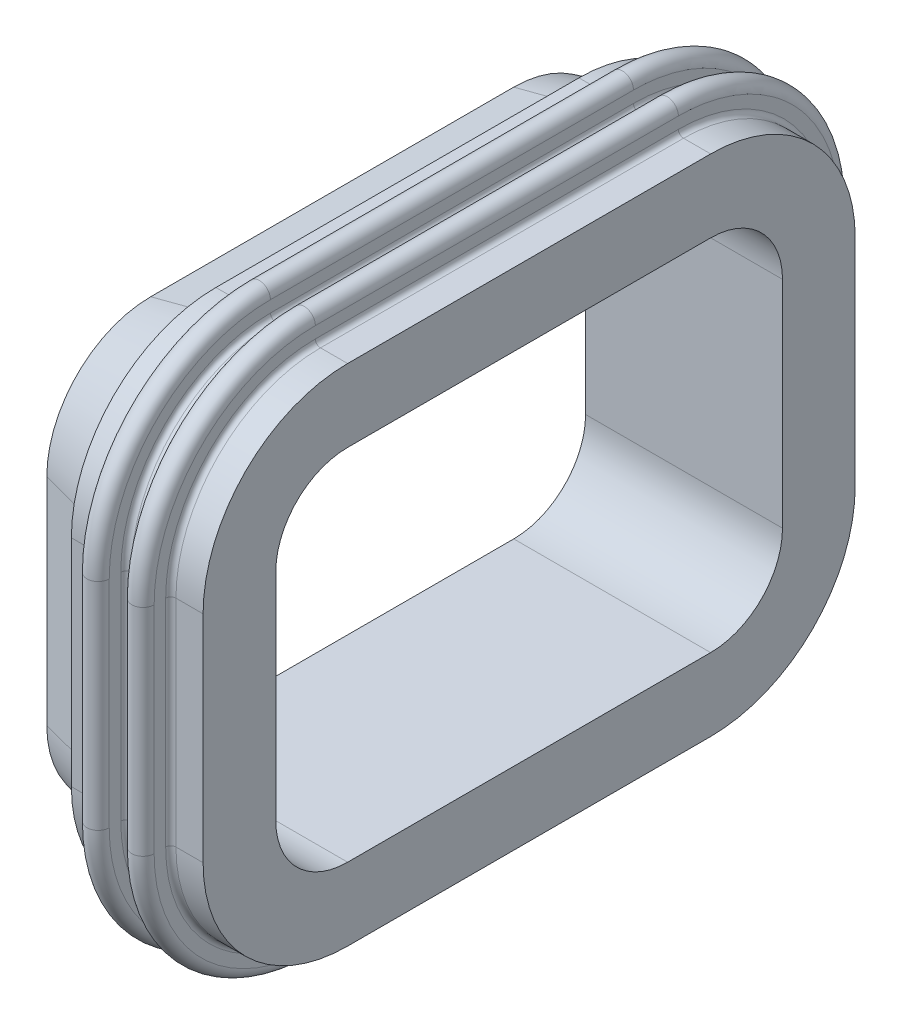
ISO-10303-21;
HEADER;
FILE_DESCRIPTION(('STEP AP214'),'2;1');
FILE_NAME('part.step','',(''),(''),'','','');
FILE_SCHEMA(('AUTOMOTIVE_DESIGN { 1 0 10303 214 1 1 1 1 }'));
ENDSEC;
DATA;
#1=APPLICATION_CONTEXT('core data for automotive mechanical design processes');
#2=APPLICATION_PROTOCOL_DEFINITION('international standard','automotive_design',2000,#1);
#3=PRODUCT_CONTEXT('',#1,'mechanical');
#4=PRODUCT('Part','Part','',(#3));
#5=PRODUCT_RELATED_PRODUCT_CATEGORY('part','',(#4));
#6=PRODUCT_DEFINITION_FORMATION('','',#4);
#7=PRODUCT_DEFINITION_CONTEXT('part definition',#1,'design');
#8=PRODUCT_DEFINITION('design','',#6,#7);
#9=PRODUCT_DEFINITION_SHAPE('','',#8);
#10=(LENGTH_UNIT() NAMED_UNIT(*) SI_UNIT(.MILLI.,.METRE.));
#11=(NAMED_UNIT(*) PLANE_ANGLE_UNIT() SI_UNIT($,.RADIAN.));
#12=(NAMED_UNIT(*) SI_UNIT($,.STERADIAN.) SOLID_ANGLE_UNIT());
#13=UNCERTAINTY_MEASURE_WITH_UNIT(LENGTH_MEASURE(1.E-05),#10,'distance_accuracy_value','');
#14=(GEOMETRIC_REPRESENTATION_CONTEXT(3) GLOBAL_UNCERTAINTY_ASSIGNED_CONTEXT((#13)) GLOBAL_UNIT_ASSIGNED_CONTEXT((#10,
#11,#12)) REPRESENTATION_CONTEXT('',''));
#15=CARTESIAN_POINT('',(0.,0.,0.));
#16=DIRECTION('',(0.,0.,1.));
#17=DIRECTION('',(1.,0.,0.));
#18=AXIS2_PLACEMENT_3D('',#15,#16,#17);
#19=CARTESIAN_POINT('',(1.525,5.35,4.245));
#20=DIRECTION('',(0.253712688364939,-0.967279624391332,0.));
#21=DIRECTION('',(0.967279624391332,0.253712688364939,0.));
#22=AXIS2_PLACEMENT_3D('',#19,#20,#21);
#23=PLANE('',#22);
#24=DIRECTION('',(-0.967279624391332,-0.253712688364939,0.));
#25=VECTOR('',#24,1.);
#26=CARTESIAN_POINT('',(1.525,5.35,-4.245));
#27=LINE('',#26,#25);
#28=CARTESIAN_POINT('',(1.525,5.35,-4.245));
#29=VERTEX_POINT('',#28);
#30=CARTESIAN_POINT('',(0.,4.95,-4.245));
#31=VERTEX_POINT('',#30);
#32=EDGE_CURVE('E11',#29,#31,#27,.T.);
#33=ORIENTED_EDGE('',*,*,#32,.T.);
#34=DIRECTION('',(0.,0.,-1.));
#35=VECTOR('',#34,1.);
#36=CARTESIAN_POINT('',(0.,4.95,4.245));
#37=LINE('',#36,#35);
#38=CARTESIAN_POINT('',(0.,4.95,4.245));
#39=VERTEX_POINT('',#38);
#40=EDGE_CURVE('E25',#39,#31,#37,.T.);
#41=ORIENTED_EDGE('',*,*,#40,.F.);
#42=DIRECTION('',(-0.967279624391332,-0.253712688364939,0.));
#43=VECTOR('',#42,1.);
#44=CARTESIAN_POINT('',(1.525,5.35,4.245));
#45=LINE('',#44,#43);
#46=CARTESIAN_POINT('',(1.525,5.35,4.245));
#47=VERTEX_POINT('',#46);
#48=EDGE_CURVE('E1515',#47,#39,#45,.T.);
#49=ORIENTED_EDGE('',*,*,#48,.F.);
#50=DIRECTION('',(0.,0.,-1.));
#51=VECTOR('',#50,1.);
#52=CARTESIAN_POINT('',(1.525,5.35,4.245));
#53=LINE('',#52,#51);
#54=EDGE_CURVE('E1511',#47,#29,#53,.T.);
#55=ORIENTED_EDGE('',*,*,#54,.T.);
#56=EDGE_LOOP('',(#33,#41,#49,#55));
#57=FACE_BOUND('',#56,.T.);
#58=ADVANCED_FACE('F17',(#57),#23,.F.);
#59=CARTESIAN_POINT('',(1.525,5.9,4.245));
#60=DIRECTION('',(1.,0.,0.));
#61=DIRECTION('',(0.,0.,-1.));
#62=AXIS2_PLACEMENT_3D('',#59,#60,#61);
#63=PLANE('',#62);
#64=CARTESIAN_POINT('',(1.525,2.52,-4.245));
#65=DIRECTION('',(1.,0.,0.));
#66=DIRECTION('',(0.,0.,-1.));
#67=AXIS2_PLACEMENT_3D('',#64,#65,#66);
#68=CIRCLE('',#67,2.83);
#69=CARTESIAN_POINT('',(1.525,2.52,-7.075));
#70=VERTEX_POINT('',#69);
#71=EDGE_CURVE('E1506',#70,#29,#68,.T.);
#72=ORIENTED_EDGE('',*,*,#71,.T.);
#73=ORIENTED_EDGE('',*,*,#54,.F.);
#74=CARTESIAN_POINT('',(1.525,2.52,4.245));
#75=DIRECTION('',(1.,0.,0.));
#76=DIRECTION('',(0.,0.,-1.));
#77=AXIS2_PLACEMENT_3D('',#74,#75,#76);
#78=CIRCLE('',#77,2.83);
#79=CARTESIAN_POINT('',(1.525,2.52,7.075));
#80=VERTEX_POINT('',#79);
#81=EDGE_CURVE('E1502',#47,#80,#78,.T.);
#82=ORIENTED_EDGE('',*,*,#81,.T.);
#83=DIRECTION('',(0.,1.,0.));
#84=VECTOR('',#83,1.);
#85=CARTESIAN_POINT('',(1.525,-2.52,7.075));
#86=LINE('',#85,#84);
#87=CARTESIAN_POINT('',(1.525,-2.52,7.075));
#88=VERTEX_POINT('',#87);
#89=EDGE_CURVE('E1497',#88,#80,#86,.T.);
#90=ORIENTED_EDGE('',*,*,#89,.F.);
#91=CARTESIAN_POINT('',(1.525,-2.52,4.245));
#92=DIRECTION('',(1.,0.,0.));
#93=DIRECTION('',(0.,0.,-1.));
#94=AXIS2_PLACEMENT_3D('',#91,#92,#93);
#95=CIRCLE('',#94,2.83);
#96=CARTESIAN_POINT('',(1.525,-5.35,4.245));
#97=VERTEX_POINT('',#96);
#98=EDGE_CURVE('E1493',#88,#97,#95,.T.);
#99=ORIENTED_EDGE('',*,*,#98,.T.);
#100=DIRECTION('',(0.,0.,1.));
#101=VECTOR('',#100,1.);
#102=CARTESIAN_POINT('',(1.525,-5.35,-4.245));
#103=LINE('',#102,#101);
#104=CARTESIAN_POINT('',(1.525,-5.35,-4.245));
#105=VERTEX_POINT('',#104);
#106=EDGE_CURVE('E1488',#105,#97,#103,.T.);
#107=ORIENTED_EDGE('',*,*,#106,.F.);
#108=CARTESIAN_POINT('',(1.525,-2.52,-4.245));
#109=DIRECTION('',(1.,0.,0.));
#110=DIRECTION('',(0.,0.,-1.));
#111=AXIS2_PLACEMENT_3D('',#108,#109,#110);
#112=CIRCLE('',#111,2.83);
#113=CARTESIAN_POINT('',(1.525,-2.52,-7.075));
#114=VERTEX_POINT('',#113);
#115=EDGE_CURVE('E1484',#105,#114,#112,.T.);
#116=ORIENTED_EDGE('',*,*,#115,.T.);
#117=DIRECTION('',(0.,-1.,0.));
#118=VECTOR('',#117,1.);
#119=CARTESIAN_POINT('',(1.525,2.52,-7.075));
#120=LINE('',#119,#118);
#121=EDGE_CURVE('E1479',#70,#114,#120,.T.);
#122=ORIENTED_EDGE('',*,*,#121,.F.);
#123=EDGE_LOOP('',(#72,#73,#82,#90,#99,#107,#116,#122));
#124=FACE_BOUND('',#123,.T.);
#125=DIRECTION('',(0.,0.,-1.));
#126=VECTOR('',#125,1.);
#127=CARTESIAN_POINT('',(1.525,5.9,4.245));
#128=LINE('',#127,#126);
#129=CARTESIAN_POINT('',(1.525,5.9,4.245));
#130=VERTEX_POINT('',#129);
#131=CARTESIAN_POINT('',(1.525,5.9,-4.245));
#132=VERTEX_POINT('',#131);
#133=EDGE_CURVE('E1475',#130,#132,#128,.T.);
#134=ORIENTED_EDGE('',*,*,#133,.T.);
#135=CARTESIAN_POINT('',(1.525,2.52,-4.245));
#136=DIRECTION('',(1.,0.,0.));
#137=DIRECTION('',(0.,0.,-1.));
#138=AXIS2_PLACEMENT_3D('',#135,#136,#137);
#139=CIRCLE('',#138,3.38);
#140=CARTESIAN_POINT('',(1.525,2.52,-7.625));
#141=VERTEX_POINT('',#140);
#142=EDGE_CURVE('E1470',#141,#132,#139,.T.);
#143=ORIENTED_EDGE('',*,*,#142,.F.);
#144=DIRECTION('',(0.,-1.,0.));
#145=VECTOR('',#144,1.);
#146=CARTESIAN_POINT('',(1.525,2.52,-7.625));
#147=LINE('',#146,#145);
#148=CARTESIAN_POINT('',(1.525,-2.52,-7.625));
#149=VERTEX_POINT('',#148);
#150=EDGE_CURVE('E1466',#141,#149,#147,.T.);
#151=ORIENTED_EDGE('',*,*,#150,.T.);
#152=CARTESIAN_POINT('',(1.525,-2.52,-4.245));
#153=DIRECTION('',(1.,0.,0.));
#154=DIRECTION('',(0.,0.,-1.));
#155=AXIS2_PLACEMENT_3D('',#152,#153,#154);
#156=CIRCLE('',#155,3.38);
#157=CARTESIAN_POINT('',(1.525,-5.9,-4.245));
#158=VERTEX_POINT('',#157);
#159=EDGE_CURVE('E1461',#158,#149,#156,.T.);
#160=ORIENTED_EDGE('',*,*,#159,.F.);
#161=DIRECTION('',(0.,0.,1.));
#162=VECTOR('',#161,1.);
#163=CARTESIAN_POINT('',(1.525,-5.9,-4.245));
#164=LINE('',#163,#162);
#165=CARTESIAN_POINT('',(1.525,-5.9,4.245));
#166=VERTEX_POINT('',#165);
#167=EDGE_CURVE('E1457',#158,#166,#164,.T.);
#168=ORIENTED_EDGE('',*,*,#167,.T.);
#169=CARTESIAN_POINT('',(1.525,-2.52,4.245));
#170=DIRECTION('',(1.,0.,0.));
#171=DIRECTION('',(0.,0.,-1.));
#172=AXIS2_PLACEMENT_3D('',#169,#170,#171);
#173=CIRCLE('',#172,3.38);
#174=CARTESIAN_POINT('',(1.525,-2.52,7.625));
#175=VERTEX_POINT('',#174);
#176=EDGE_CURVE('E1453',#175,#166,#173,.T.);
#177=ORIENTED_EDGE('',*,*,#176,.F.);
#178=DIRECTION('',(0.,1.,0.));
#179=VECTOR('',#178,1.);
#180=CARTESIAN_POINT('',(1.525,-2.52,7.625));
#181=LINE('',#180,#179);
#182=CARTESIAN_POINT('',(1.525,2.52,7.625));
#183=VERTEX_POINT('',#182);
#184=EDGE_CURVE('E492',#175,#183,#181,.T.);
#185=ORIENTED_EDGE('',*,*,#184,.T.);
#186=CARTESIAN_POINT('',(1.525,2.52,4.245));
#187=DIRECTION('',(1.,0.,0.));
#188=DIRECTION('',(0.,0.,-1.));
#189=AXIS2_PLACEMENT_3D('',#186,#187,#188);
#190=CIRCLE('',#189,3.38);
#191=EDGE_CURVE('E1445',#130,#183,#190,.T.);
#192=ORIENTED_EDGE('',*,*,#191,.F.);
#193=EDGE_LOOP('',(#134,#143,#151,#160,#168,#177,#185,#192));
#194=FACE_BOUND('',#193,.T.);
#195=ADVANCED_FACE('F1534',(#124,#194),#63,.F.);
#196=CARTESIAN_POINT('',(4.605,2.52,4.245));
#197=DIRECTION('',(1.,0.,0.));
#198=DIRECTION('',(0.,-0.707106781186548,-0.707106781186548));
#199=AXIS2_PLACEMENT_3D('',#196,#197,#198);
#200=CYLINDRICAL_SURFACE('',#199,3.38);
#201=ORIENTED_EDGE('',*,*,#191,.T.);
#202=DIRECTION('',(-1.,0.,0.));
#203=VECTOR('',#202,1.);
#204=CARTESIAN_POINT('',(2.16,2.52,7.625));
#205=LINE('',#204,#203);
#206=CARTESIAN_POINT('',(2.16,2.52,7.625));
#207=VERTEX_POINT('',#206);
#208=EDGE_CURVE('E1441',#207,#183,#205,.T.);
#209=ORIENTED_EDGE('',*,*,#208,.F.);
#210=CARTESIAN_POINT('',(2.16,2.52,4.245));
#211=DIRECTION('',(1.,0.,0.));
#212=DIRECTION('',(0.,0.,-1.));
#213=AXIS2_PLACEMENT_3D('',#210,#211,#212);
#214=CIRCLE('',#213,3.38);
#215=CARTESIAN_POINT('',(2.16,5.9,4.245));
#216=VERTEX_POINT('',#215);
#217=EDGE_CURVE('E1437',#216,#207,#214,.T.);
#218=ORIENTED_EDGE('',*,*,#217,.F.);
#219=DIRECTION('',(-1.,0.,0.));
#220=VECTOR('',#219,1.);
#221=CARTESIAN_POINT('',(2.16,5.9,4.245));
#222=LINE('',#221,#220);
#223=EDGE_CURVE('E1432',#216,#130,#222,.T.);
#224=ORIENTED_EDGE('',*,*,#223,.T.);
#225=EDGE_LOOP('',(#201,#209,#218,#224));
#226=FACE_BOUND('',#225,.T.);
#227=ADVANCED_FACE('F1570',(#226),#200,.T.);
#228=CARTESIAN_POINT('',(2.16,5.9,4.245));
#229=DIRECTION('',(0.,-1.,0.));
#230=DIRECTION('',(0.,0.,-1.));
#231=AXIS2_PLACEMENT_3D('',#228,#229,#230);
#232=PLANE('',#231);
#233=DIRECTION('',(-1.,0.,0.));
#234=VECTOR('',#233,1.);
#235=CARTESIAN_POINT('',(2.16,5.9,-4.245));
#236=LINE('',#235,#234);
#237=CARTESIAN_POINT('',(2.16,5.9,-4.245));
#238=VERTEX_POINT('',#237);
#239=EDGE_CURVE('E1427',#238,#132,#236,.T.);
#240=ORIENTED_EDGE('',*,*,#239,.T.);
#241=ORIENTED_EDGE('',*,*,#133,.F.);
#242=ORIENTED_EDGE('',*,*,#223,.F.);
#243=DIRECTION('',(0.,0.,-1.));
#244=VECTOR('',#243,1.);
#245=CARTESIAN_POINT('',(2.16,5.9,4.245));
#246=LINE('',#245,#244);
#247=EDGE_CURVE('E1423',#216,#238,#246,.T.);
#248=ORIENTED_EDGE('',*,*,#247,.T.);
#249=EDGE_LOOP('',(#240,#241,#242,#248));
#250=FACE_BOUND('',#249,.T.);
#251=ADVANCED_FACE('F1574',(#250),#232,.F.);
#252=CARTESIAN_POINT('',(2.16000000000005,6.02,4.245));
#253=DIRECTION('',(0.,0.,-1.));
#254=DIRECTION('',(-0.707106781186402,0.707106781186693,0.));
#255=AXIS2_PLACEMENT_3D('',#252,#253,#254);
#256=CYLINDRICAL_SURFACE('',#255,0.11999999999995);
#257=CARTESIAN_POINT('',(2.16000000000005,6.02,-4.245));
#258=DIRECTION('',(0.,0.,1.));
#259=DIRECTION('',(1.,0.,0.));
#260=AXIS2_PLACEMENT_3D('',#257,#258,#259);
#261=CIRCLE('',#260,0.11999999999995);
#262=CARTESIAN_POINT('',(2.28,6.02,-4.245));
#263=VERTEX_POINT('',#262);
#264=EDGE_CURVE('E1419',#238,#263,#261,.T.);
#265=ORIENTED_EDGE('',*,*,#264,.F.);
#266=ORIENTED_EDGE('',*,*,#247,.F.);
#267=CARTESIAN_POINT('',(2.16000000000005,6.02,4.245));
#268=DIRECTION('',(0.,0.,1.));
#269=DIRECTION('',(1.,0.,0.));
#270=AXIS2_PLACEMENT_3D('',#267,#268,#269);
#271=CIRCLE('',#270,0.11999999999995);
#272=CARTESIAN_POINT('',(2.28,6.02,4.245));
#273=VERTEX_POINT('',#272);
#274=EDGE_CURVE('E1415',#216,#273,#271,.T.);
#275=ORIENTED_EDGE('',*,*,#274,.T.);
#276=DIRECTION('',(0.,0.,-1.));
#277=VECTOR('',#276,1.);
#278=CARTESIAN_POINT('',(2.28,6.02,4.245));
#279=LINE('',#278,#277);
#280=EDGE_CURVE('E1413',#273,#263,#279,.T.);
#281=ORIENTED_EDGE('',*,*,#280,.T.);
#282=EDGE_LOOP('',(#265,#266,#275,#281));
#283=FACE_BOUND('',#282,.T.);
#284=ADVANCED_FACE('F1393',(#283),#256,.F.);
#285=CARTESIAN_POINT('',(2.28,6.29,4.245));
#286=DIRECTION('',(1.,0.,0.));
#287=DIRECTION('',(0.,0.,-1.));
#288=AXIS2_PLACEMENT_3D('',#285,#286,#287);
#289=PLANE('',#288);
#290=CARTESIAN_POINT('',(2.28,2.52,-7.745));
#291=CARTESIAN_POINT('',(2.28,3.61928255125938,-7.74465515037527));
#292=CARTESIAN_POINT('',(2.28,4.7202693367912,-7.314732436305));
#293=CARTESIAN_POINT('',(2.28,5.58973243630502,-6.4452693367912));
#294=CARTESIAN_POINT('',(2.28,6.01965515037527,-5.34428255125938));
#295=CARTESIAN_POINT('',(2.28,6.02,-4.245));
#296=B_SPLINE_CURVE_WITH_KNOTS('',5,(#290,#291,#292,#293,#294,#295),.UNSPECIFIED.,.F.,.F.,(6,6),
(0.,1.5707963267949),.UNSPECIFIED.);
#297=CARTESIAN_POINT('',(2.28,2.52,-7.745));
#298=VERTEX_POINT('',#297);
#299=EDGE_CURVE('E1411',#298,#263,#296,.T.);
#300=ORIENTED_EDGE('',*,*,#299,.T.);
#301=ORIENTED_EDGE('',*,*,#280,.F.);
#302=CARTESIAN_POINT('',(2.28,2.52,4.245));
#303=DIRECTION('',(1.,0.,0.));
#304=DIRECTION('',(0.,0.,-1.));
#305=AXIS2_PLACEMENT_3D('',#302,#303,#304);
#306=CIRCLE('',#305,3.5);
#307=CARTESIAN_POINT('',(2.28,2.52,7.745));
#308=VERTEX_POINT('',#307);
#309=EDGE_CURVE('E1596',#273,#308,#306,.T.);
#310=ORIENTED_EDGE('',*,*,#309,.T.);
#311=DIRECTION('',(0.,1.,0.));
#312=VECTOR('',#311,1.);
#313=CARTESIAN_POINT('',(2.28,-2.52,7.745));
#314=LINE('',#313,#312);
#315=CARTESIAN_POINT('',(2.28,-2.52,7.745));
#316=VERTEX_POINT('',#315);
#317=EDGE_CURVE('E1677',#316,#308,#314,.T.);
#318=ORIENTED_EDGE('',*,*,#317,.F.);
#319=CARTESIAN_POINT('',(2.28,-2.52,4.245));
#320=DIRECTION('',(1.,0.,0.));
#321=DIRECTION('',(0.,0.,-1.));
#322=AXIS2_PLACEMENT_3D('',#319,#320,#321);
#323=CIRCLE('',#322,3.5);
#324=CARTESIAN_POINT('',(2.28,-6.02,4.245));
#325=VERTEX_POINT('',#324);
#326=EDGE_CURVE('E469',#316,#325,#323,.T.);
#327=ORIENTED_EDGE('',*,*,#326,.T.);
#328=DIRECTION('',(0.,0.,1.));
#329=VECTOR('',#328,1.);
#330=CARTESIAN_POINT('',(2.28,-6.02,-4.245));
#331=LINE('',#330,#329);
#332=CARTESIAN_POINT('',(2.28,-6.02,-4.245));
#333=VERTEX_POINT('',#332);
#334=EDGE_CURVE('E1669',#333,#325,#331,.T.);
#335=ORIENTED_EDGE('',*,*,#334,.F.);
#336=CARTESIAN_POINT('',(2.28,-2.52,-4.245));
#337=DIRECTION('',(1.,0.,0.));
#338=DIRECTION('',(0.,0.,-1.));
#339=AXIS2_PLACEMENT_3D('',#336,#337,#338);
#340=CIRCLE('',#339,3.5);
#341=CARTESIAN_POINT('',(2.28,-2.52,-7.745));
#342=VERTEX_POINT('',#341);
#343=EDGE_CURVE('E1665',#333,#342,#340,.T.);
#344=ORIENTED_EDGE('',*,*,#343,.T.);
#345=DIRECTION('',(0.,-1.,0.));
#346=VECTOR('',#345,1.);
#347=CARTESIAN_POINT('',(2.28,2.52,-7.745));
#348=LINE('',#347,#346);
#349=EDGE_CURVE('E1660',#298,#342,#348,.T.);
#350=ORIENTED_EDGE('',*,*,#349,.F.);
#351=EDGE_LOOP('',(#300,#301,#310,#318,#327,#335,#344,#350));
#352=FACE_BOUND('',#351,.T.);
#353=DIRECTION('',(0.,0.,-1.));
#354=VECTOR('',#353,1.);
#355=CARTESIAN_POINT('',(2.28,6.29,4.245));
#356=LINE('',#355,#354);
#357=CARTESIAN_POINT('',(2.28,6.29,4.245));
#358=VERTEX_POINT('',#357);
#359=CARTESIAN_POINT('',(2.28,6.29,-4.245));
#360=VERTEX_POINT('',#359);
#361=EDGE_CURVE('E1656',#358,#360,#356,.T.);
#362=ORIENTED_EDGE('',*,*,#361,.T.);
#363=CARTESIAN_POINT('',(2.28,2.52,-4.245));
#364=DIRECTION('',(1.,0.,0.));
#365=DIRECTION('',(0.,0.,-1.));
#366=AXIS2_PLACEMENT_3D('',#363,#364,#365);
#367=CIRCLE('',#366,3.77);
#368=CARTESIAN_POINT('',(2.28,2.52,-8.015));
#369=VERTEX_POINT('',#368);
#370=EDGE_CURVE('E1651',#369,#360,#367,.T.);
#371=ORIENTED_EDGE('',*,*,#370,.F.);
#372=DIRECTION('',(0.,-1.,0.));
#373=VECTOR('',#372,1.);
#374=CARTESIAN_POINT('',(2.28,2.52,-8.015));
#375=LINE('',#374,#373);
#376=CARTESIAN_POINT('',(2.28,-2.52,-8.015));
#377=VERTEX_POINT('',#376);
#378=EDGE_CURVE('E1639',#369,#377,#375,.T.);
#379=ORIENTED_EDGE('',*,*,#378,.T.);
#380=CARTESIAN_POINT('',(2.28,-2.52,-4.245));
#381=DIRECTION('',(1.,0.,0.));
#382=DIRECTION('',(0.,0.,-1.));
#383=AXIS2_PLACEMENT_3D('',#380,#381,#382);
#384=CIRCLE('',#383,3.77);
#385=CARTESIAN_POINT('',(2.28,-6.29,-4.245));
#386=VERTEX_POINT('',#385);
#387=EDGE_CURVE('E1632',#386,#377,#384,.T.);
#388=ORIENTED_EDGE('',*,*,#387,.F.);
#389=DIRECTION('',(0.,0.,1.));
#390=VECTOR('',#389,1.);
#391=CARTESIAN_POINT('',(2.28,-6.29,-4.245));
#392=LINE('',#391,#390);
#393=CARTESIAN_POINT('',(2.28,-6.29,4.245));
#394=VERTEX_POINT('',#393);
#395=EDGE_CURVE('E1633',#386,#394,#392,.T.);
#396=ORIENTED_EDGE('',*,*,#395,.T.);
#397=CARTESIAN_POINT('',(2.28,-2.52,4.245));
#398=DIRECTION('',(1.,0.,0.));
#399=DIRECTION('',(0.,0.,-1.));
#400=AXIS2_PLACEMENT_3D('',#397,#398,#399);
#401=CIRCLE('',#400,3.77);
#402=CARTESIAN_POINT('',(2.28,-2.52,8.015));
#403=VERTEX_POINT('',#402);
#404=EDGE_CURVE('E1637',#403,#394,#401,.T.);
#405=ORIENTED_EDGE('',*,*,#404,.F.);
#406=DIRECTION('',(0.,1.,0.));
#407=VECTOR('',#406,1.);
#408=CARTESIAN_POINT('',(2.28,-2.52,8.015));
#409=LINE('',#408,#407);
#410=CARTESIAN_POINT('',(2.28,2.52,8.015));
#411=VERTEX_POINT('',#410);
#412=EDGE_CURVE('E1641',#403,#411,#409,.T.);
#413=ORIENTED_EDGE('',*,*,#412,.T.);
#414=CARTESIAN_POINT('',(2.28,2.52,4.245));
#415=DIRECTION('',(1.,0.,0.));
#416=DIRECTION('',(0.,0.,-1.));
#417=AXIS2_PLACEMENT_3D('',#414,#415,#416);
#418=CIRCLE('',#417,3.77);
#419=EDGE_CURVE('E2889',#358,#411,#418,.T.);
#420=ORIENTED_EDGE('',*,*,#419,.F.);
#421=EDGE_LOOP('',(#362,#371,#379,#388,#396,#405,#413,#420));
#422=FACE_BOUND('',#421,.T.);
#423=ADVANCED_FACE('F1388',(#352,#422),#289,.F.);
#424=CARTESIAN_POINT('',(2.54,2.52,4.245));
#425=DIRECTION('',(1.,0.,0.));
#426=DIRECTION('',(0.,-0.707106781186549,-0.707106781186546));
#427=AXIS2_PLACEMENT_3D('',#424,#425,#426);
#428=TOROIDAL_SURFACE('',#427,3.77,0.26);
#429=ORIENTED_EDGE('',*,*,#419,.T.);
#430=CARTESIAN_POINT('',(2.54,2.52,8.015));
#431=DIRECTION('',(0.,-1.,0.));
#432=DIRECTION('',(1.,0.,0.));
#433=AXIS2_PLACEMENT_3D('',#430,#431,#432);
#434=CIRCLE('',#433,0.26);
#435=CARTESIAN_POINT('',(2.8,2.52,8.015));
#436=VERTEX_POINT('',#435);
#437=EDGE_CURVE('E2892',#436,#411,#434,.T.);
#438=ORIENTED_EDGE('',*,*,#437,.F.);
#439=CARTESIAN_POINT('',(2.8,2.52,4.245));
#440=DIRECTION('',(1.,0.,0.));
#441=DIRECTION('',(0.,0.,-1.));
#442=AXIS2_PLACEMENT_3D('',#439,#440,#441);
#443=CIRCLE('',#442,3.77);
#444=CARTESIAN_POINT('',(2.8,6.29,4.245));
#445=VERTEX_POINT('',#444);
#446=EDGE_CURVE('E2893',#445,#436,#443,.T.);
#447=ORIENTED_EDGE('',*,*,#446,.F.);
#448=CARTESIAN_POINT('',(2.54,6.29,4.245));
#449=DIRECTION('',(0.,0.,1.));
#450=DIRECTION('',(1.,0.,0.));
#451=AXIS2_PLACEMENT_3D('',#448,#449,#450);
#452=CIRCLE('',#451,0.26);
#453=EDGE_CURVE('E2896',#445,#358,#452,.T.);
#454=ORIENTED_EDGE('',*,*,#453,.T.);
#455=EDGE_LOOP('',(#429,#438,#447,#454));
#456=FACE_BOUND('',#455,.T.);
#457=ADVANCED_FACE('F1384',(#456),#428,.T.);
#458=CARTESIAN_POINT('',(2.54,6.29,4.245));
#459=DIRECTION('',(0.,0.,-1.));
#460=DIRECTION('',(0.,-1.,0.));
#461=AXIS2_PLACEMENT_3D('',#458,#459,#460);
#462=CYLINDRICAL_SURFACE('',#461,0.26);
#463=CARTESIAN_POINT('',(2.54,6.29,-4.245));
#464=DIRECTION('',(0.,0.,1.));
#465=DIRECTION('',(1.,0.,0.));
#466=AXIS2_PLACEMENT_3D('',#463,#464,#465);
#467=CIRCLE('',#466,0.26);
#468=CARTESIAN_POINT('',(2.8,6.29,-4.245));
#469=VERTEX_POINT('',#468);
#470=EDGE_CURVE('E2912',#469,#360,#467,.T.);
#471=ORIENTED_EDGE('',*,*,#470,.T.);
#472=ORIENTED_EDGE('',*,*,#361,.F.);
#473=ORIENTED_EDGE('',*,*,#453,.F.);
#474=DIRECTION('',(0.,0.,-1.));
#475=VECTOR('',#474,1.);
#476=CARTESIAN_POINT('',(2.8,6.29,4.245));
#477=LINE('',#476,#475);
#478=EDGE_CURVE('E2917',#445,#469,#477,.T.);
#479=ORIENTED_EDGE('',*,*,#478,.T.);
#480=EDGE_LOOP('',(#471,#472,#473,#479));
#481=FACE_BOUND('',#480,.T.);
#482=ADVANCED_FACE('F1379',(#481),#462,.T.);
#483=CARTESIAN_POINT('',(2.8,6.02,4.245));
#484=DIRECTION('',(-1.,0.,0.));
#485=DIRECTION('',(0.,0.,1.));
#486=AXIS2_PLACEMENT_3D('',#483,#484,#485);
#487=PLANE('',#486);
#488=CARTESIAN_POINT('',(2.8,2.52,-8.015));
#489=CARTESIAN_POINT('',(2.8,3.70408434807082,-8.01462854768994));
#490=CARTESIAN_POINT('',(2.8,4.8900043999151,-7.55154036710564));
#491=CARTESIAN_POINT('',(2.8,5.82654036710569,-6.61500439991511));
#492=CARTESIAN_POINT('',(2.8,6.28962854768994,-5.42908434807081));
#493=CARTESIAN_POINT('',(2.8,6.29,-4.245));
#494=B_SPLINE_CURVE_WITH_KNOTS('',5,(#488,#489,#490,#491,#492,#493),.UNSPECIFIED.,.F.,.F.,(6,6),
(0.,1.5707963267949),.UNSPECIFIED.);
#495=CARTESIAN_POINT('',(2.8,2.52,-8.015));
#496=VERTEX_POINT('',#495);
#497=EDGE_CURVE('E609',#496,#469,#494,.T.);
#498=ORIENTED_EDGE('',*,*,#497,.T.);
#499=ORIENTED_EDGE('',*,*,#478,.F.);
#500=ORIENTED_EDGE('',*,*,#446,.T.);
#501=DIRECTION('',(0.,1.,0.));
#502=VECTOR('',#501,1.);
#503=CARTESIAN_POINT('',(2.8,-2.52,8.015));
#504=LINE('',#503,#502);
#505=CARTESIAN_POINT('',(2.8,-2.52,8.015));
#506=VERTEX_POINT('',#505);
#507=EDGE_CURVE('E1356',#506,#436,#504,.T.);
#508=ORIENTED_EDGE('',*,*,#507,.F.);
#509=CARTESIAN_POINT('',(2.8,-2.52,4.245));
#510=DIRECTION('',(1.,0.,0.));
#511=DIRECTION('',(0.,0.,-1.));
#512=AXIS2_PLACEMENT_3D('',#509,#510,#511);
#513=CIRCLE('',#512,3.77);
#514=CARTESIAN_POINT('',(2.8,-6.29,4.245));
#515=VERTEX_POINT('',#514);
#516=EDGE_CURVE('E1352',#506,#515,#513,.T.);
#517=ORIENTED_EDGE('',*,*,#516,.T.);
#518=DIRECTION('',(0.,0.,1.));
#519=VECTOR('',#518,1.);
#520=CARTESIAN_POINT('',(2.8,-6.29,-4.245));
#521=LINE('',#520,#519);
#522=CARTESIAN_POINT('',(2.8,-6.29,-4.245));
#523=VERTEX_POINT('',#522);
#524=EDGE_CURVE('E1347',#523,#515,#521,.T.);
#525=ORIENTED_EDGE('',*,*,#524,.F.);
#526=CARTESIAN_POINT('',(2.8,-2.52,-4.245));
#527=DIRECTION('',(1.,0.,0.));
#528=DIRECTION('',(0.,0.,-1.));
#529=AXIS2_PLACEMENT_3D('',#526,#527,#528);
#530=CIRCLE('',#529,3.77);
#531=CARTESIAN_POINT('',(2.8,-2.52,-8.015));
#532=VERTEX_POINT('',#531);
#533=EDGE_CURVE('E1343',#523,#532,#530,.T.);
#534=ORIENTED_EDGE('',*,*,#533,.T.);
#535=DIRECTION('',(0.,-1.,0.));
#536=VECTOR('',#535,1.);
#537=CARTESIAN_POINT('',(2.8,2.52,-8.015));
#538=LINE('',#537,#536);
#539=EDGE_CURVE('E1338',#496,#532,#538,.T.);
#540=ORIENTED_EDGE('',*,*,#539,.F.);
#541=EDGE_LOOP('',(#498,#499,#500,#508,#517,#525,#534,#540));
#542=FACE_BOUND('',#541,.T.);
#543=DIRECTION('',(0.,0.,-1.));
#544=VECTOR('',#543,1.);
#545=CARTESIAN_POINT('',(2.8,6.02,4.245));
#546=LINE('',#545,#544);
#547=CARTESIAN_POINT('',(2.8,6.02,4.245));
#548=VERTEX_POINT('',#547);
#549=CARTESIAN_POINT('',(2.8,6.02,-4.245));
#550=VERTEX_POINT('',#549);
#551=EDGE_CURVE('E1334',#548,#550,#546,.T.);
#552=ORIENTED_EDGE('',*,*,#551,.T.);
#553=CARTESIAN_POINT('',(2.8,2.52,-4.245));
#554=DIRECTION('',(1.,0.,0.));
#555=DIRECTION('',(0.,0.,-1.));
#556=AXIS2_PLACEMENT_3D('',#553,#554,#555);
#557=CIRCLE('',#556,3.5);
#558=CARTESIAN_POINT('',(2.8,2.52,-7.745));
#559=VERTEX_POINT('',#558);
#560=EDGE_CURVE('E1329',#559,#550,#557,.T.);
#561=ORIENTED_EDGE('',*,*,#560,.F.);
#562=DIRECTION('',(0.,-1.,0.));
#563=VECTOR('',#562,1.);
#564=CARTESIAN_POINT('',(2.8,2.52,-7.745));
#565=LINE('',#564,#563);
#566=CARTESIAN_POINT('',(2.8,-2.52,-7.745));
#567=VERTEX_POINT('',#566);
#568=EDGE_CURVE('E1325',#559,#567,#565,.T.);
#569=ORIENTED_EDGE('',*,*,#568,.T.);
#570=CARTESIAN_POINT('',(2.8,-2.52,-4.245));
#571=DIRECTION('',(1.,0.,0.));
#572=DIRECTION('',(0.,0.,-1.));
#573=AXIS2_PLACEMENT_3D('',#570,#571,#572);
#574=CIRCLE('',#573,3.5);
#575=CARTESIAN_POINT('',(2.8,-6.02,-4.245));
#576=VERTEX_POINT('',#575);
#577=EDGE_CURVE('E1320',#576,#567,#574,.T.);
#578=ORIENTED_EDGE('',*,*,#577,.F.);
#579=DIRECTION('',(0.,0.,1.));
#580=VECTOR('',#579,1.);
#581=CARTESIAN_POINT('',(2.8,-6.02,-4.245));
#582=LINE('',#581,#580);
#583=CARTESIAN_POINT('',(2.8,-6.02,4.245));
#584=VERTEX_POINT('',#583);
#585=EDGE_CURVE('E1316',#576,#584,#582,.T.);
#586=ORIENTED_EDGE('',*,*,#585,.T.);
#587=CARTESIAN_POINT('',(2.8,-2.52,4.245));
#588=DIRECTION('',(1.,0.,0.));
#589=DIRECTION('',(0.,0.,-1.));
#590=AXIS2_PLACEMENT_3D('',#587,#588,#589);
#591=CIRCLE('',#590,3.5);
#592=CARTESIAN_POINT('',(2.8,-2.52,7.745));
#593=VERTEX_POINT('',#592);
#594=EDGE_CURVE('E1311',#593,#584,#591,.T.);
#595=ORIENTED_EDGE('',*,*,#594,.F.);
#596=DIRECTION('',(0.,1.,0.));
#597=VECTOR('',#596,1.);
#598=CARTESIAN_POINT('',(2.8,-2.52,7.745));
#599=LINE('',#598,#597);
#600=CARTESIAN_POINT('',(2.8,2.52,7.745));
#601=VERTEX_POINT('',#600);
#602=EDGE_CURVE('E1307',#593,#601,#599,.T.);
#603=ORIENTED_EDGE('',*,*,#602,.T.);
#604=CARTESIAN_POINT('',(2.8,2.52,4.245));
#605=DIRECTION('',(1.,0.,0.));
#606=DIRECTION('',(0.,0.,-1.));
#607=AXIS2_PLACEMENT_3D('',#604,#605,#606);
#608=CIRCLE('',#607,3.5);
#609=EDGE_CURVE('E1302',#548,#601,#608,.T.);
#610=ORIENTED_EDGE('',*,*,#609,.F.);
#611=EDGE_LOOP('',(#552,#561,#569,#578,#586,#595,#603,#610));
#612=FACE_BOUND('',#611,.T.);
#613=ADVANCED_FACE('F1368',(#542,#612),#487,.F.);
#614=CARTESIAN_POINT('',(2.91999999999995,2.52,4.245));
#615=DIRECTION('',(1.,0.,0.));
#616=DIRECTION('',(0.,-0.707106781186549,-0.707106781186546));
#617=AXIS2_PLACEMENT_3D('',#614,#615,#616);
#618=TOROIDAL_SURFACE('',#617,3.49999999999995,0.119999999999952);
#619=ORIENTED_EDGE('',*,*,#609,.T.);
#620=CARTESIAN_POINT('',(2.91999999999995,2.52,7.745));
#621=DIRECTION('',(0.,-1.,0.));
#622=DIRECTION('',(1.,0.,0.));
#623=AXIS2_PLACEMENT_3D('',#620,#621,#622);
#624=CIRCLE('',#623,0.119999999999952);
#625=CARTESIAN_POINT('',(2.92,2.52,7.625));
#626=VERTEX_POINT('',#625);
#627=EDGE_CURVE('E1298',#601,#626,#624,.T.);
#628=ORIENTED_EDGE('',*,*,#627,.T.);
#629=CARTESIAN_POINT('',(2.92,2.52,4.245));
#630=DIRECTION('',(1.,0.,0.));
#631=DIRECTION('',(0.,0.,-1.));
#632=AXIS2_PLACEMENT_3D('',#629,#630,#631);
#633=CIRCLE('',#632,3.38);
#634=CARTESIAN_POINT('',(2.92,5.9,4.245));
#635=VERTEX_POINT('',#634);
#636=EDGE_CURVE('E1293',#635,#626,#633,.T.);
#637=ORIENTED_EDGE('',*,*,#636,.F.);
#638=CARTESIAN_POINT('',(2.91999999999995,6.02,4.245));
#639=DIRECTION('',(0.,0.,1.));
#640=DIRECTION('',(1.,0.,0.));
#641=AXIS2_PLACEMENT_3D('',#638,#639,#640);
#642=CIRCLE('',#641,0.119999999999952);
#643=EDGE_CURVE('E1288',#548,#635,#642,.T.);
#644=ORIENTED_EDGE('',*,*,#643,.F.);
#645=EDGE_LOOP('',(#619,#628,#637,#644));
#646=FACE_BOUND('',#645,.T.);
#647=ADVANCED_FACE('F1378',(#646),#618,.F.);
#648=CARTESIAN_POINT('',(2.91999999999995,6.02,4.245));
#649=DIRECTION('',(0.,0.,-1.));
#650=DIRECTION('',(0.707106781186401,0.707106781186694,0.));
#651=AXIS2_PLACEMENT_3D('',#648,#649,#650);
#652=CYLINDRICAL_SURFACE('',#651,0.119999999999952);
#653=CARTESIAN_POINT('',(2.91999999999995,6.02,-4.245));
#654=DIRECTION('',(0.,0.,1.));
#655=DIRECTION('',(1.,0.,0.));
#656=AXIS2_PLACEMENT_3D('',#653,#654,#655);
#657=CIRCLE('',#656,0.119999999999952);
#658=CARTESIAN_POINT('',(2.92,5.9,-4.245));
#659=VERTEX_POINT('',#658);
#660=EDGE_CURVE('E1283',#550,#659,#657,.T.);
#661=ORIENTED_EDGE('',*,*,#660,.F.);
#662=ORIENTED_EDGE('',*,*,#551,.F.);
#663=ORIENTED_EDGE('',*,*,#643,.T.);
#664=DIRECTION('',(0.,0.,-1.));
#665=VECTOR('',#664,1.);
#666=CARTESIAN_POINT('',(2.92,5.9,4.245));
#667=LINE('',#666,#665);
#668=EDGE_CURVE('E1279',#635,#659,#667,.T.);
#669=ORIENTED_EDGE('',*,*,#668,.T.);
#670=EDGE_LOOP('',(#661,#662,#663,#669));
#671=FACE_BOUND('',#670,.T.);
#672=ADVANCED_FACE('F2223',(#671),#652,.F.);
#673=CARTESIAN_POINT('',(3.21,5.9,4.245));
#674=DIRECTION('',(0.,-1.,0.));
#675=DIRECTION('',(0.,0.,-1.));
#676=AXIS2_PLACEMENT_3D('',#673,#674,#675);
#677=PLANE('',#676);
#678=DIRECTION('',(-1.,0.,0.));
#679=VECTOR('',#678,1.);
#680=CARTESIAN_POINT('',(3.21,5.9,-4.245));
#681=LINE('',#680,#679);
#682=CARTESIAN_POINT('',(3.21,5.9,-4.245));
#683=VERTEX_POINT('',#682);
#684=EDGE_CURVE('E1274',#683,#659,#681,.T.);
#685=ORIENTED_EDGE('',*,*,#684,.T.);
#686=ORIENTED_EDGE('',*,*,#668,.F.);
#687=DIRECTION('',(-1.,0.,0.));
#688=VECTOR('',#687,1.);
#689=CARTESIAN_POINT('',(3.21,5.9,4.245));
#690=LINE('',#689,#688);
#691=CARTESIAN_POINT('',(3.21,5.9,4.245));
#692=VERTEX_POINT('',#691);
#693=EDGE_CURVE('E1269',#692,#635,#690,.T.);
#694=ORIENTED_EDGE('',*,*,#693,.F.);
#695=DIRECTION('',(0.,0.,-1.));
#696=VECTOR('',#695,1.);
#697=CARTESIAN_POINT('',(3.21,5.9,4.245));
#698=LINE('',#697,#696);
#699=EDGE_CURVE('E1265',#692,#683,#698,.T.);
#700=ORIENTED_EDGE('',*,*,#699,.T.);
#701=EDGE_LOOP('',(#685,#686,#694,#700));
#702=FACE_BOUND('',#701,.T.);
#703=ADVANCED_FACE('F2214',(#702),#677,.F.);
#704=CARTESIAN_POINT('',(3.21000000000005,6.02,4.245));
#705=DIRECTION('',(0.,0.,-1.));
#706=DIRECTION('',(-0.7071067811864,0.707106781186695,0.));
#707=AXIS2_PLACEMENT_3D('',#704,#705,#706);
#708=CYLINDRICAL_SURFACE('',#707,0.119999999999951);
#709=CARTESIAN_POINT('',(3.21000000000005,6.02,-4.245));
#710=DIRECTION('',(0.,0.,1.));
#711=DIRECTION('',(1.,0.,0.));
#712=AXIS2_PLACEMENT_3D('',#709,#710,#711);
#713=CIRCLE('',#712,0.119999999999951);
#714=CARTESIAN_POINT('',(3.33,6.02,-4.245));
#715=VERTEX_POINT('',#714);
#716=EDGE_CURVE('E1261',#683,#715,#713,.T.);
#717=ORIENTED_EDGE('',*,*,#716,.F.);
#718=ORIENTED_EDGE('',*,*,#699,.F.);
#719=CARTESIAN_POINT('',(3.21000000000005,6.02,4.245));
#720=DIRECTION('',(0.,0.,1.));
#721=DIRECTION('',(1.,0.,0.));
#722=AXIS2_PLACEMENT_3D('',#719,#720,#721);
#723=CIRCLE('',#722,0.119999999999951);
#724=CARTESIAN_POINT('',(3.33,6.02,4.245));
#725=VERTEX_POINT('',#724);
#726=EDGE_CURVE('E1257',#692,#725,#723,.T.);
#727=ORIENTED_EDGE('',*,*,#726,.T.);
#728=DIRECTION('',(0.,0.,-1.));
#729=VECTOR('',#728,1.);
#730=CARTESIAN_POINT('',(3.33,6.02,4.245));
#731=LINE('',#730,#729);
#732=EDGE_CURVE('E1255',#725,#715,#731,.T.);
#733=ORIENTED_EDGE('',*,*,#732,.T.);
#734=EDGE_LOOP('',(#717,#718,#727,#733));
#735=FACE_BOUND('',#734,.T.);
#736=ADVANCED_FACE('F1235',(#735),#708,.F.);
#737=CARTESIAN_POINT('',(3.33,6.29,4.245));
#738=DIRECTION('',(1.,0.,0.));
#739=DIRECTION('',(0.,0.,-1.));
#740=AXIS2_PLACEMENT_3D('',#737,#738,#739);
#741=PLANE('',#740);
#742=CARTESIAN_POINT('',(3.33,2.52,-7.745));
#743=CARTESIAN_POINT('',(3.33,3.61928255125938,-7.74465515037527));
#744=CARTESIAN_POINT('',(3.33,4.7202693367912,-7.314732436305));
#745=CARTESIAN_POINT('',(3.33,5.58973243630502,-6.4452693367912));
#746=CARTESIAN_POINT('',(3.33,6.01965515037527,-5.34428255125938));
#747=CARTESIAN_POINT('',(3.33,6.02,-4.245));
#748=B_SPLINE_CURVE_WITH_KNOTS('',5,(#742,#743,#744,#745,#746,#747),.UNSPECIFIED.,.F.,.F.,(6,6),
(0.,1.5707963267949),.UNSPECIFIED.);
#749=CARTESIAN_POINT('',(3.33,2.52,-7.745));
#750=VERTEX_POINT('',#749);
#751=EDGE_CURVE('E1253',#750,#715,#748,.T.);
#752=ORIENTED_EDGE('',*,*,#751,.T.);
#753=ORIENTED_EDGE('',*,*,#732,.F.);
#754=CARTESIAN_POINT('',(3.33,2.52,4.245));
#755=DIRECTION('',(1.,0.,0.));
#756=DIRECTION('',(0.,0.,-1.));
#757=AXIS2_PLACEMENT_3D('',#754,#755,#756);
#758=CIRCLE('',#757,3.5);
#759=CARTESIAN_POINT('',(3.33,2.52,7.745));
#760=VERTEX_POINT('',#759);
#761=EDGE_CURVE('E2699',#725,#760,#758,.T.);
#762=ORIENTED_EDGE('',*,*,#761,.T.);
#763=DIRECTION('',(0.,1.,0.));
#764=VECTOR('',#763,1.);
#765=CARTESIAN_POINT('',(3.33,-2.52,7.745));
#766=LINE('',#765,#764);
#767=CARTESIAN_POINT('',(3.33,-2.52,7.745));
#768=VERTEX_POINT('',#767);
#769=EDGE_CURVE('E2697',#768,#760,#766,.T.);
#770=ORIENTED_EDGE('',*,*,#769,.F.);
#771=CARTESIAN_POINT('',(3.33,-2.52,4.245));
#772=DIRECTION('',(1.,0.,0.));
#773=DIRECTION('',(0.,0.,-1.));
#774=AXIS2_PLACEMENT_3D('',#771,#772,#773);
#775=CIRCLE('',#774,3.5);
#776=CARTESIAN_POINT('',(3.33,-6.02,4.245));
#777=VERTEX_POINT('',#776);
#778=EDGE_CURVE('E2717',#768,#777,#775,.T.);
#779=ORIENTED_EDGE('',*,*,#778,.T.);
#780=DIRECTION('',(0.,0.,1.));
#781=VECTOR('',#780,1.);
#782=CARTESIAN_POINT('',(3.33,-6.02,-4.245));
#783=LINE('',#782,#781);
#784=CARTESIAN_POINT('',(3.33,-6.02,-4.245));
#785=VERTEX_POINT('',#784);
#786=EDGE_CURVE('E2716',#785,#777,#783,.T.);
#787=ORIENTED_EDGE('',*,*,#786,.F.);
#788=CARTESIAN_POINT('',(3.33,-2.52,-4.245));
#789=DIRECTION('',(1.,0.,0.));
#790=DIRECTION('',(0.,0.,-1.));
#791=AXIS2_PLACEMENT_3D('',#788,#789,#790);
#792=CIRCLE('',#791,3.5);
#793=CARTESIAN_POINT('',(3.33,-2.52,-7.745));
#794=VERTEX_POINT('',#793);
#795=EDGE_CURVE('E2720',#785,#794,#792,.T.);
#796=ORIENTED_EDGE('',*,*,#795,.T.);
#797=DIRECTION('',(0.,-1.,0.));
#798=VECTOR('',#797,1.);
#799=CARTESIAN_POINT('',(3.33,2.52,-7.745));
#800=LINE('',#799,#798);
#801=EDGE_CURVE('E2738',#750,#794,#800,.T.);
#802=ORIENTED_EDGE('',*,*,#801,.F.);
#803=EDGE_LOOP('',(#752,#753,#762,#770,#779,#787,#796,#802));
#804=FACE_BOUND('',#803,.T.);
#805=DIRECTION('',(0.,0.,-1.));
#806=VECTOR('',#805,1.);
#807=CARTESIAN_POINT('',(3.33,6.29,4.245));
#808=LINE('',#807,#806);
#809=CARTESIAN_POINT('',(3.33,6.29,4.245));
#810=VERTEX_POINT('',#809);
#811=CARTESIAN_POINT('',(3.33,6.29,-4.245));
#812=VERTEX_POINT('',#811);
#813=EDGE_CURVE('E2730',#810,#812,#808,.T.);
#814=ORIENTED_EDGE('',*,*,#813,.T.);
#815=CARTESIAN_POINT('',(3.33,2.52,-4.245));
#816=DIRECTION('',(1.,0.,0.));
#817=DIRECTION('',(0.,0.,-1.));
#818=AXIS2_PLACEMENT_3D('',#815,#816,#817);
#819=CIRCLE('',#818,3.77);
#820=CARTESIAN_POINT('',(3.33,2.52,-8.015));
#821=VERTEX_POINT('',#820);
#822=EDGE_CURVE('E2733',#821,#812,#819,.T.);
#823=ORIENTED_EDGE('',*,*,#822,.F.);
#824=DIRECTION('',(0.,-1.,0.));
#825=VECTOR('',#824,1.);
#826=CARTESIAN_POINT('',(3.33,2.52,-8.015));
#827=LINE('',#826,#825);
#828=CARTESIAN_POINT('',(3.33,-2.52,-8.015));
#829=VERTEX_POINT('',#828);
#830=EDGE_CURVE('E2747',#821,#829,#827,.T.);
#831=ORIENTED_EDGE('',*,*,#830,.T.);
#832=CARTESIAN_POINT('',(3.33,-2.52,-4.245));
#833=DIRECTION('',(1.,0.,0.));
#834=DIRECTION('',(0.,0.,-1.));
#835=AXIS2_PLACEMENT_3D('',#832,#833,#834);
#836=CIRCLE('',#835,3.77);
#837=CARTESIAN_POINT('',(3.33,-6.29,-4.245));
#838=VERTEX_POINT('',#837);
#839=EDGE_CURVE('E2749',#838,#829,#836,.T.);
#840=ORIENTED_EDGE('',*,*,#839,.F.);
#841=DIRECTION('',(0.,0.,1.));
#842=VECTOR('',#841,1.);
#843=CARTESIAN_POINT('',(3.33,-6.29,-4.245));
#844=LINE('',#843,#842);
#845=CARTESIAN_POINT('',(3.33,-6.29,4.245));
#846=VERTEX_POINT('',#845);
#847=EDGE_CURVE('E2794',#838,#846,#844,.T.);
#848=ORIENTED_EDGE('',*,*,#847,.T.);
#849=CARTESIAN_POINT('',(3.33,-2.52,4.245));
#850=DIRECTION('',(1.,0.,0.));
#851=DIRECTION('',(0.,0.,-1.));
#852=AXIS2_PLACEMENT_3D('',#849,#850,#851);
#853=CIRCLE('',#852,3.77);
#854=CARTESIAN_POINT('',(3.33,-2.52,8.015));
#855=VERTEX_POINT('',#854);
#856=EDGE_CURVE('E2797',#855,#846,#853,.T.);
#857=ORIENTED_EDGE('',*,*,#856,.F.);
#858=DIRECTION('',(0.,1.,0.));
#859=VECTOR('',#858,1.);
#860=CARTESIAN_POINT('',(3.33,-2.52,8.015));
#861=LINE('',#860,#859);
#862=CARTESIAN_POINT('',(3.33,2.52,8.015));
#863=VERTEX_POINT('',#862);
#864=EDGE_CURVE('E2800',#855,#863,#861,.T.);
#865=ORIENTED_EDGE('',*,*,#864,.T.);
#866=CARTESIAN_POINT('',(3.33,2.52,4.245));
#867=DIRECTION('',(1.,0.,0.));
#868=DIRECTION('',(0.,0.,-1.));
#869=AXIS2_PLACEMENT_3D('',#866,#867,#868);
#870=CIRCLE('',#869,3.77);
#871=EDGE_CURVE('E2735',#810,#863,#870,.T.);
#872=ORIENTED_EDGE('',*,*,#871,.F.);
#873=EDGE_LOOP('',(#814,#823,#831,#840,#848,#857,#865,#872));
#874=FACE_BOUND('',#873,.T.);
#875=ADVANCED_FACE('F1230',(#804,#874),#741,.F.);
#876=CARTESIAN_POINT('',(3.59,2.52,4.245));
#877=DIRECTION('',(1.,0.,0.));
#878=DIRECTION('',(0.,-0.707106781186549,-0.707106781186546));
#879=AXIS2_PLACEMENT_3D('',#876,#877,#878);
#880=TOROIDAL_SURFACE('',#879,3.77,0.26);
#881=ORIENTED_EDGE('',*,*,#871,.T.);
#882=CARTESIAN_POINT('',(3.59,2.52,8.015));
#883=DIRECTION('',(0.,-1.,0.));
#884=DIRECTION('',(1.,0.,0.));
#885=AXIS2_PLACEMENT_3D('',#882,#883,#884);
#886=CIRCLE('',#885,0.26);
#887=CARTESIAN_POINT('',(3.85,2.52,8.015));
#888=VERTEX_POINT('',#887);
#889=EDGE_CURVE('E2815',#888,#863,#886,.T.);
#890=ORIENTED_EDGE('',*,*,#889,.F.);
#891=CARTESIAN_POINT('',(3.85,2.52,4.245));
#892=DIRECTION('',(1.,0.,0.));
#893=DIRECTION('',(0.,0.,-1.));
#894=AXIS2_PLACEMENT_3D('',#891,#892,#893);
#895=CIRCLE('',#894,3.77);
#896=CARTESIAN_POINT('',(3.85,6.29,4.245));
#897=VERTEX_POINT('',#896);
#898=EDGE_CURVE('E2820',#897,#888,#895,.T.);
#899=ORIENTED_EDGE('',*,*,#898,.F.);
#900=CARTESIAN_POINT('',(3.59,6.29,4.245));
#901=DIRECTION('',(0.,0.,1.));
#902=DIRECTION('',(1.,0.,0.));
#903=AXIS2_PLACEMENT_3D('',#900,#901,#902);
#904=CIRCLE('',#903,0.26);
#905=EDGE_CURVE('E2743',#897,#810,#904,.T.);
#906=ORIENTED_EDGE('',*,*,#905,.T.);
#907=EDGE_LOOP('',(#881,#890,#899,#906));
#908=FACE_BOUND('',#907,.T.);
#909=ADVANCED_FACE('F1226',(#908),#880,.T.);
#910=CARTESIAN_POINT('',(3.59,6.29,4.245));
#911=DIRECTION('',(0.,0.,-1.));
#912=DIRECTION('',(0.,-1.,0.));
#913=AXIS2_PLACEMENT_3D('',#910,#911,#912);
#914=CYLINDRICAL_SURFACE('',#913,0.26);
#915=CARTESIAN_POINT('',(3.59,6.29,-4.245));
#916=DIRECTION('',(0.,0.,1.));
#917=DIRECTION('',(1.,0.,0.));
#918=AXIS2_PLACEMENT_3D('',#915,#916,#917);
#919=CIRCLE('',#918,0.26);
#920=CARTESIAN_POINT('',(3.85,6.29,-4.245));
#921=VERTEX_POINT('',#920);
#922=EDGE_CURVE('E2740',#921,#812,#919,.T.);
#923=ORIENTED_EDGE('',*,*,#922,.T.);
#924=ORIENTED_EDGE('',*,*,#813,.F.);
#925=ORIENTED_EDGE('',*,*,#905,.F.);
#926=DIRECTION('',(0.,0.,-1.));
#927=VECTOR('',#926,1.);
#928=CARTESIAN_POINT('',(3.85,6.29,4.245));
#929=LINE('',#928,#927);
#930=EDGE_CURVE('E2742',#897,#921,#929,.T.);
#931=ORIENTED_EDGE('',*,*,#930,.T.);
#932=EDGE_LOOP('',(#923,#924,#925,#931));
#933=FACE_BOUND('',#932,.T.);
#934=ADVANCED_FACE('F1221',(#933),#914,.T.);
#935=CARTESIAN_POINT('',(3.85,6.02,4.245));
#936=DIRECTION('',(-1.,0.,0.));
#937=DIRECTION('',(0.,0.,1.));
#938=AXIS2_PLACEMENT_3D('',#935,#936,#937);
#939=PLANE('',#938);
#940=CARTESIAN_POINT('',(3.85,2.52,-8.015));
#941=CARTESIAN_POINT('',(3.85,3.70408434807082,-8.01462854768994));
#942=CARTESIAN_POINT('',(3.85,4.8900043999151,-7.55154036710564));
#943=CARTESIAN_POINT('',(3.85,5.82654036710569,-6.61500439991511));
#944=CARTESIAN_POINT('',(3.85,6.28962854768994,-5.42908434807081));
#945=CARTESIAN_POINT('',(3.85,6.29,-4.245));
#946=B_SPLINE_CURVE_WITH_KNOTS('',5,(#940,#941,#942,#943,#944,#945),.UNSPECIFIED.,.F.,.F.,(6,6),
(0.,1.5707963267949),.UNSPECIFIED.);
#947=CARTESIAN_POINT('',(3.85,2.52,-8.015));
#948=VERTEX_POINT('',#947);
#949=EDGE_CURVE('E810',#948,#921,#946,.T.);
#950=ORIENTED_EDGE('',*,*,#949,.T.);
#951=ORIENTED_EDGE('',*,*,#930,.F.);
#952=ORIENTED_EDGE('',*,*,#898,.T.);
#953=DIRECTION('',(0.,1.,0.));
#954=VECTOR('',#953,1.);
#955=CARTESIAN_POINT('',(3.85,-2.52,8.015));
#956=LINE('',#955,#954);
#957=CARTESIAN_POINT('',(3.85,-2.52,8.015));
#958=VERTEX_POINT('',#957);
#959=EDGE_CURVE('E1198',#958,#888,#956,.T.);
#960=ORIENTED_EDGE('',*,*,#959,.F.);
#961=CARTESIAN_POINT('',(3.85,-2.52,4.245));
#962=DIRECTION('',(1.,0.,0.));
#963=DIRECTION('',(0.,0.,-1.));
#964=AXIS2_PLACEMENT_3D('',#961,#962,#963);
#965=CIRCLE('',#964,3.77);
#966=CARTESIAN_POINT('',(3.85,-6.29,4.245));
#967=VERTEX_POINT('',#966);
#968=EDGE_CURVE('E1194',#958,#967,#965,.T.);
#969=ORIENTED_EDGE('',*,*,#968,.T.);
#970=DIRECTION('',(0.,0.,1.));
#971=VECTOR('',#970,1.);
#972=CARTESIAN_POINT('',(3.85,-6.29,-4.245));
#973=LINE('',#972,#971);
#974=CARTESIAN_POINT('',(3.85,-6.29,-4.245));
#975=VERTEX_POINT('',#974);
#976=EDGE_CURVE('E1189',#975,#967,#973,.T.);
#977=ORIENTED_EDGE('',*,*,#976,.F.);
#978=CARTESIAN_POINT('',(3.85,-2.52,-4.245));
#979=DIRECTION('',(1.,0.,0.));
#980=DIRECTION('',(0.,0.,-1.));
#981=AXIS2_PLACEMENT_3D('',#978,#979,#980);
#982=CIRCLE('',#981,3.77);
#983=CARTESIAN_POINT('',(3.85,-2.52,-8.015));
#984=VERTEX_POINT('',#983);
#985=EDGE_CURVE('E1185',#975,#984,#982,.T.);
#986=ORIENTED_EDGE('',*,*,#985,.T.);
#987=DIRECTION('',(0.,-1.,0.));
#988=VECTOR('',#987,1.);
#989=CARTESIAN_POINT('',(3.85,2.52,-8.015));
#990=LINE('',#989,#988);
#991=EDGE_CURVE('E1180',#948,#984,#990,.T.);
#992=ORIENTED_EDGE('',*,*,#991,.F.);
#993=EDGE_LOOP('',(#950,#951,#952,#960,#969,#977,#986,#992));
#994=FACE_BOUND('',#993,.T.);
#995=DIRECTION('',(0.,0.,-1.));
#996=VECTOR('',#995,1.);
#997=CARTESIAN_POINT('',(3.85,6.02,4.245));
#998=LINE('',#997,#996);
#999=CARTESIAN_POINT('',(3.85,6.02,4.245));
#1000=VERTEX_POINT('',#999);
#1001=CARTESIAN_POINT('',(3.85,6.02,-4.245));
#1002=VERTEX_POINT('',#1001);
#1003=EDGE_CURVE('E1176',#1000,#1002,#998,.T.);
#1004=ORIENTED_EDGE('',*,*,#1003,.T.);
#1005=CARTESIAN_POINT('',(3.85,2.52,-4.245));
#1006=DIRECTION('',(1.,0.,0.));
#1007=DIRECTION('',(0.,0.,-1.));
#1008=AXIS2_PLACEMENT_3D('',#1005,#1006,#1007);
#1009=CIRCLE('',#1008,3.5);
#1010=CARTESIAN_POINT('',(3.85,2.52,-7.745));
#1011=VERTEX_POINT('',#1010);
#1012=EDGE_CURVE('E1171',#1011,#1002,#1009,.T.);
#1013=ORIENTED_EDGE('',*,*,#1012,.F.);
#1014=DIRECTION('',(0.,-1.,0.));
#1015=VECTOR('',#1014,1.);
#1016=CARTESIAN_POINT('',(3.85,2.52,-7.745));
#1017=LINE('',#1016,#1015);
#1018=CARTESIAN_POINT('',(3.85,-2.52,-7.745));
#1019=VERTEX_POINT('',#1018);
#1020=EDGE_CURVE('E1167',#1011,#1019,#1017,.T.);
#1021=ORIENTED_EDGE('',*,*,#1020,.T.);
#1022=CARTESIAN_POINT('',(3.85,-2.52,-4.245));
#1023=DIRECTION('',(1.,0.,0.));
#1024=DIRECTION('',(0.,0.,-1.));
#1025=AXIS2_PLACEMENT_3D('',#1022,#1023,#1024);
#1026=CIRCLE('',#1025,3.5);
#1027=CARTESIAN_POINT('',(3.85,-6.02,-4.245));
#1028=VERTEX_POINT('',#1027);
#1029=EDGE_CURVE('E1162',#1028,#1019,#1026,.T.);
#1030=ORIENTED_EDGE('',*,*,#1029,.F.);
#1031=DIRECTION('',(0.,0.,1.));
#1032=VECTOR('',#1031,1.);
#1033=CARTESIAN_POINT('',(3.85,-6.02,-4.245));
#1034=LINE('',#1033,#1032);
#1035=CARTESIAN_POINT('',(3.85,-6.02,4.245));
#1036=VERTEX_POINT('',#1035);
#1037=EDGE_CURVE('E1158',#1028,#1036,#1034,.T.);
#1038=ORIENTED_EDGE('',*,*,#1037,.T.);
#1039=CARTESIAN_POINT('',(3.85,-2.52,4.245));
#1040=DIRECTION('',(1.,0.,0.));
#1041=DIRECTION('',(0.,0.,-1.));
#1042=AXIS2_PLACEMENT_3D('',#1039,#1040,#1041);
#1043=CIRCLE('',#1042,3.5);
#1044=CARTESIAN_POINT('',(3.85,-2.52,7.745));
#1045=VERTEX_POINT('',#1044);
#1046=EDGE_CURVE('E1153',#1045,#1036,#1043,.T.);
#1047=ORIENTED_EDGE('',*,*,#1046,.F.);
#1048=DIRECTION('',(0.,1.,0.));
#1049=VECTOR('',#1048,1.);
#1050=CARTESIAN_POINT('',(3.85,-2.52,7.745));
#1051=LINE('',#1050,#1049);
#1052=CARTESIAN_POINT('',(3.85,2.52,7.745));
#1053=VERTEX_POINT('',#1052);
#1054=EDGE_CURVE('E1149',#1045,#1053,#1051,.T.);
#1055=ORIENTED_EDGE('',*,*,#1054,.T.);
#1056=CARTESIAN_POINT('',(3.85,2.52,4.245));
#1057=DIRECTION('',(1.,0.,0.));
#1058=DIRECTION('',(0.,0.,-1.));
#1059=AXIS2_PLACEMENT_3D('',#1056,#1057,#1058);
#1060=CIRCLE('',#1059,3.5);
#1061=EDGE_CURVE('E1144',#1000,#1053,#1060,.T.);
#1062=ORIENTED_EDGE('',*,*,#1061,.F.);
#1063=EDGE_LOOP('',(#1004,#1013,#1021,#1030,#1038,#1047,#1055,#1062));
#1064=FACE_BOUND('',#1063,.T.);
#1065=ADVANCED_FACE('F1210',(#994,#1064),#939,.F.);
#1066=CARTESIAN_POINT('',(3.96999999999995,2.52,4.245));
#1067=DIRECTION('',(1.,0.,0.));
#1068=DIRECTION('',(0.,-0.707106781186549,-0.707106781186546));
#1069=AXIS2_PLACEMENT_3D('',#1066,#1067,#1068);
#1070=TOROIDAL_SURFACE('',#1069,3.49999999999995,0.119999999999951);
#1071=ORIENTED_EDGE('',*,*,#1061,.T.);
#1072=CARTESIAN_POINT('',(3.96999999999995,2.52,7.745));
#1073=DIRECTION('',(0.,-1.,0.));
#1074=DIRECTION('',(1.,0.,0.));
#1075=AXIS2_PLACEMENT_3D('',#1072,#1073,#1074);
#1076=CIRCLE('',#1075,0.119999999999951);
#1077=CARTESIAN_POINT('',(3.97,2.52,7.625));
#1078=VERTEX_POINT('',#1077);
#1079=EDGE_CURVE('E1140',#1053,#1078,#1076,.T.);
#1080=ORIENTED_EDGE('',*,*,#1079,.T.);
#1081=CARTESIAN_POINT('',(3.97,2.52,4.245));
#1082=DIRECTION('',(1.,0.,0.));
#1083=DIRECTION('',(0.,0.,-1.));
#1084=AXIS2_PLACEMENT_3D('',#1081,#1082,#1083);
#1085=CIRCLE('',#1084,3.38);
#1086=CARTESIAN_POINT('',(3.97,5.9,4.245));
#1087=VERTEX_POINT('',#1086);
#1088=EDGE_CURVE('E1135',#1087,#1078,#1085,.T.);
#1089=ORIENTED_EDGE('',*,*,#1088,.F.);
#1090=CARTESIAN_POINT('',(3.96999999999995,6.02,4.245));
#1091=DIRECTION('',(0.,0.,1.));
#1092=DIRECTION('',(1.,0.,0.));
#1093=AXIS2_PLACEMENT_3D('',#1090,#1091,#1092);
#1094=CIRCLE('',#1093,0.11999999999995);
#1095=EDGE_CURVE('E1130',#1000,#1087,#1094,.T.);
#1096=ORIENTED_EDGE('',*,*,#1095,.F.);
#1097=EDGE_LOOP('',(#1071,#1080,#1089,#1096));
#1098=FACE_BOUND('',#1097,.T.);
#1099=ADVANCED_FACE('F1220',(#1098),#1070,.F.);
#1100=CARTESIAN_POINT('',(3.96999999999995,6.02,4.245));
#1101=DIRECTION('',(0.,0.,-1.));
#1102=DIRECTION('',(0.707106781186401,0.707106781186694,0.));
#1103=AXIS2_PLACEMENT_3D('',#1100,#1101,#1102);
#1104=CYLINDRICAL_SURFACE('',#1103,0.11999999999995);
#1105=CARTESIAN_POINT('',(3.96999999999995,6.02,-4.245));
#1106=DIRECTION('',(0.,0.,1.));
#1107=DIRECTION('',(1.,0.,0.));
#1108=AXIS2_PLACEMENT_3D('',#1105,#1106,#1107);
#1109=CIRCLE('',#1108,0.11999999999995);
#1110=CARTESIAN_POINT('',(3.97,5.9,-4.245));
#1111=VERTEX_POINT('',#1110);
#1112=EDGE_CURVE('E1125',#1002,#1111,#1109,.T.);
#1113=ORIENTED_EDGE('',*,*,#1112,.F.);
#1114=ORIENTED_EDGE('',*,*,#1003,.F.);
#1115=ORIENTED_EDGE('',*,*,#1095,.T.);
#1116=DIRECTION('',(0.,0.,-1.));
#1117=VECTOR('',#1116,1.);
#1118=CARTESIAN_POINT('',(3.97,5.9,4.245));
#1119=LINE('',#1118,#1117);
#1120=EDGE_CURVE('E1121',#1087,#1111,#1119,.T.);
#1121=ORIENTED_EDGE('',*,*,#1120,.T.);
#1122=EDGE_LOOP('',(#1113,#1114,#1115,#1121));
#1123=FACE_BOUND('',#1122,.T.);
#1124=ADVANCED_FACE('F2164',(#1123),#1104,.F.);
#1125=CARTESIAN_POINT('',(4.605,5.9,4.245));
#1126=DIRECTION('',(0.,-1.,0.));
#1127=DIRECTION('',(0.,0.,-1.));
#1128=AXIS2_PLACEMENT_3D('',#1125,#1126,#1127);
#1129=PLANE('',#1128);
#1130=DIRECTION('',(-1.,0.,0.));
#1131=VECTOR('',#1130,1.);
#1132=CARTESIAN_POINT('',(4.605,5.9,-4.245));
#1133=LINE('',#1132,#1131);
#1134=CARTESIAN_POINT('',(4.605,5.9,-4.245));
#1135=VERTEX_POINT('',#1134);
#1136=EDGE_CURVE('E1116',#1135,#1111,#1133,.T.);
#1137=ORIENTED_EDGE('',*,*,#1136,.T.);
#1138=ORIENTED_EDGE('',*,*,#1120,.F.);
#1139=DIRECTION('',(-1.,0.,0.));
#1140=VECTOR('',#1139,1.);
#1141=CARTESIAN_POINT('',(4.605,5.9,4.245));
#1142=LINE('',#1141,#1140);
#1143=CARTESIAN_POINT('',(4.605,5.9,4.245));
#1144=VERTEX_POINT('',#1143);
#1145=EDGE_CURVE('E1111',#1144,#1087,#1142,.T.);
#1146=ORIENTED_EDGE('',*,*,#1145,.F.);
#1147=DIRECTION('',(0.,0.,-1.));
#1148=VECTOR('',#1147,1.);
#1149=CARTESIAN_POINT('',(4.605,5.9,4.245));
#1150=LINE('',#1149,#1148);
#1151=EDGE_CURVE('E1107',#1144,#1135,#1150,.T.);
#1152=ORIENTED_EDGE('',*,*,#1151,.T.);
#1153=EDGE_LOOP('',(#1137,#1138,#1146,#1152));
#1154=FACE_BOUND('',#1153,.T.);
#1155=ADVANCED_FACE('F2154',(#1154),#1129,.F.);
#1156=CARTESIAN_POINT('',(4.605,4.2,4.245));
#1157=DIRECTION('',(-1.,0.,0.));
#1158=DIRECTION('',(0.,0.,1.));
#1159=AXIS2_PLACEMENT_3D('',#1156,#1157,#1158);
#1160=PLANE('',#1159);
#1161=CARTESIAN_POINT('',(4.605,2.52,-4.245));
#1162=DIRECTION('',(1.,0.,0.));
#1163=DIRECTION('',(0.,0.,-1.));
#1164=AXIS2_PLACEMENT_3D('',#1161,#1162,#1163);
#1165=CIRCLE('',#1164,3.38);
#1166=CARTESIAN_POINT('',(4.605,2.52,-7.625));
#1167=VERTEX_POINT('',#1166);
#1168=EDGE_CURVE('E1102',#1167,#1135,#1165,.T.);
#1169=ORIENTED_EDGE('',*,*,#1168,.T.);
#1170=ORIENTED_EDGE('',*,*,#1151,.F.);
#1171=CARTESIAN_POINT('',(4.605,2.52,4.245));
#1172=DIRECTION('',(1.,0.,0.));
#1173=DIRECTION('',(0.,0.,-1.));
#1174=AXIS2_PLACEMENT_3D('',#1171,#1172,#1173);
#1175=CIRCLE('',#1174,3.38);
#1176=CARTESIAN_POINT('',(4.605,2.52,7.625));
#1177=VERTEX_POINT('',#1176);
#1178=EDGE_CURVE('E1098',#1144,#1177,#1175,.T.);
#1179=ORIENTED_EDGE('',*,*,#1178,.T.);
#1180=DIRECTION('',(0.,1.,0.));
#1181=VECTOR('',#1180,1.);
#1182=CARTESIAN_POINT('',(4.605,-2.52,7.625));
#1183=LINE('',#1182,#1181);
#1184=CARTESIAN_POINT('',(4.605,-2.52,7.625));
#1185=VERTEX_POINT('',#1184);
#1186=EDGE_CURVE('E1093',#1185,#1177,#1183,.T.);
#1187=ORIENTED_EDGE('',*,*,#1186,.F.);
#1188=CARTESIAN_POINT('',(4.605,-2.52,4.245));
#1189=DIRECTION('',(1.,0.,0.));
#1190=DIRECTION('',(0.,0.,-1.));
#1191=AXIS2_PLACEMENT_3D('',#1188,#1189,#1190);
#1192=CIRCLE('',#1191,3.38);
#1193=CARTESIAN_POINT('',(4.605,-5.9,4.245));
#1194=VERTEX_POINT('',#1193);
#1195=EDGE_CURVE('E1089',#1185,#1194,#1192,.T.);
#1196=ORIENTED_EDGE('',*,*,#1195,.T.);
#1197=DIRECTION('',(0.,0.,1.));
#1198=VECTOR('',#1197,1.);
#1199=CARTESIAN_POINT('',(4.605,-5.9,-4.245));
#1200=LINE('',#1199,#1198);
#1201=CARTESIAN_POINT('',(4.605,-5.9,-4.245));
#1202=VERTEX_POINT('',#1201);
#1203=EDGE_CURVE('E1084',#1202,#1194,#1200,.T.);
#1204=ORIENTED_EDGE('',*,*,#1203,.F.);
#1205=CARTESIAN_POINT('',(4.605,-2.52,-4.245));
#1206=DIRECTION('',(1.,0.,0.));
#1207=DIRECTION('',(0.,0.,-1.));
#1208=AXIS2_PLACEMENT_3D('',#1205,#1206,#1207);
#1209=CIRCLE('',#1208,3.38);
#1210=CARTESIAN_POINT('',(4.605,-2.52,-7.625));
#1211=VERTEX_POINT('',#1210);
#1212=EDGE_CURVE('E1080',#1202,#1211,#1209,.T.);
#1213=ORIENTED_EDGE('',*,*,#1212,.T.);
#1214=DIRECTION('',(0.,-1.,0.));
#1215=VECTOR('',#1214,1.);
#1216=CARTESIAN_POINT('',(4.605,2.52,-7.625));
#1217=LINE('',#1216,#1215);
#1218=EDGE_CURVE('E1075',#1167,#1211,#1217,.T.);
#1219=ORIENTED_EDGE('',*,*,#1218,.F.);
#1220=EDGE_LOOP('',(#1169,#1170,#1179,#1187,#1196,#1204,#1213,#1219));
#1221=FACE_BOUND('',#1220,.T.);
#1222=DIRECTION('',(0.,0.,-1.));
#1223=VECTOR('',#1222,1.);
#1224=CARTESIAN_POINT('',(4.605,4.2,4.245));
#1225=LINE('',#1224,#1223);
#1226=CARTESIAN_POINT('',(4.605,4.2,4.245));
#1227=VERTEX_POINT('',#1226);
#1228=CARTESIAN_POINT('',(4.605,4.2,-4.245));
#1229=VERTEX_POINT('',#1228);
#1230=EDGE_CURVE('E1071',#1227,#1229,#1225,.T.);
#1231=ORIENTED_EDGE('',*,*,#1230,.T.);
#1232=CARTESIAN_POINT('',(4.605,2.52,-4.245));
#1233=DIRECTION('',(1.,0.,0.));
#1234=DIRECTION('',(0.,0.,-1.));
#1235=AXIS2_PLACEMENT_3D('',#1232,#1233,#1234);
#1236=CIRCLE('',#1235,1.68);
#1237=CARTESIAN_POINT('',(4.605,2.52,-5.925));
#1238=VERTEX_POINT('',#1237);
#1239=EDGE_CURVE('E1066',#1238,#1229,#1236,.T.);
#1240=ORIENTED_EDGE('',*,*,#1239,.F.);
#1241=DIRECTION('',(0.,-1.,0.));
#1242=VECTOR('',#1241,1.);
#1243=CARTESIAN_POINT('',(4.605,2.52,-5.925));
#1244=LINE('',#1243,#1242);
#1245=CARTESIAN_POINT('',(4.605,-2.52,-5.925));
#1246=VERTEX_POINT('',#1245);
#1247=EDGE_CURVE('E1062',#1238,#1246,#1244,.T.);
#1248=ORIENTED_EDGE('',*,*,#1247,.T.);
#1249=CARTESIAN_POINT('',(4.605,-2.52,-4.245));
#1250=DIRECTION('',(1.,0.,0.));
#1251=DIRECTION('',(0.,0.,-1.));
#1252=AXIS2_PLACEMENT_3D('',#1249,#1250,#1251);
#1253=CIRCLE('',#1252,1.68);
#1254=CARTESIAN_POINT('',(4.605,-4.2,-4.245));
#1255=VERTEX_POINT('',#1254);
#1256=EDGE_CURVE('E1057',#1255,#1246,#1253,.T.);
#1257=ORIENTED_EDGE('',*,*,#1256,.F.);
#1258=DIRECTION('',(0.,0.,1.));
#1259=VECTOR('',#1258,1.);
#1260=CARTESIAN_POINT('',(4.605,-4.2,-4.245));
#1261=LINE('',#1260,#1259);
#1262=CARTESIAN_POINT('',(4.605,-4.2,4.245));
#1263=VERTEX_POINT('',#1262);
#1264=EDGE_CURVE('E1053',#1255,#1263,#1261,.T.);
#1265=ORIENTED_EDGE('',*,*,#1264,.T.);
#1266=CARTESIAN_POINT('',(4.605,-2.52,4.245));
#1267=DIRECTION('',(1.,0.,0.));
#1268=DIRECTION('',(0.,0.,-1.));
#1269=AXIS2_PLACEMENT_3D('',#1266,#1267,#1268);
#1270=CIRCLE('',#1269,1.68);
#1271=CARTESIAN_POINT('',(4.605,-2.52,5.925));
#1272=VERTEX_POINT('',#1271);
#1273=EDGE_CURVE('E1048',#1272,#1263,#1270,.T.);
#1274=ORIENTED_EDGE('',*,*,#1273,.F.);
#1275=DIRECTION('',(0.,1.,0.));
#1276=VECTOR('',#1275,1.);
#1277=CARTESIAN_POINT('',(4.605,-2.52,5.925));
#1278=LINE('',#1277,#1276);
#1279=CARTESIAN_POINT('',(4.605,2.52,5.925));
#1280=VERTEX_POINT('',#1279);
#1281=EDGE_CURVE('E1044',#1272,#1280,#1278,.T.);
#1282=ORIENTED_EDGE('',*,*,#1281,.T.);
#1283=CARTESIAN_POINT('',(4.605,2.52,4.245));
#1284=DIRECTION('',(1.,0.,0.));
#1285=DIRECTION('',(0.,0.,-1.));
#1286=AXIS2_PLACEMENT_3D('',#1283,#1284,#1285);
#1287=CIRCLE('',#1286,1.68);
#1288=EDGE_CURVE('E1039',#1227,#1280,#1287,.T.);
#1289=ORIENTED_EDGE('',*,*,#1288,.F.);
#1290=EDGE_LOOP('',(#1231,#1240,#1248,#1257,#1265,#1274,#1282,#1289));
#1291=FACE_BOUND('',#1290,.T.);
#1292=ADVANCED_FACE('F2144',(#1221,#1291),#1160,.F.);
#1293=CARTESIAN_POINT('',(4.605,2.52,4.245));
#1294=DIRECTION('',(1.,0.,0.));
#1295=DIRECTION('',(0.,-0.707106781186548,-0.707106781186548));
#1296=AXIS2_PLACEMENT_3D('',#1293,#1294,#1295);
#1297=CYLINDRICAL_SURFACE('',#1296,1.68);
#1298=ORIENTED_EDGE('',*,*,#1288,.T.);
#1299=DIRECTION('',(1.,0.,0.));
#1300=VECTOR('',#1299,1.);
#1301=CARTESIAN_POINT('',(0.,2.52,5.925));
#1302=LINE('',#1301,#1300);
#1303=CARTESIAN_POINT('',(0.,2.52,5.925));
#1304=VERTEX_POINT('',#1303);
#1305=EDGE_CURVE('E1034',#1304,#1280,#1302,.T.);
#1306=ORIENTED_EDGE('',*,*,#1305,.F.);
#1307=CARTESIAN_POINT('',(0.,2.52,4.245));
#1308=DIRECTION('',(1.,0.,0.));
#1309=DIRECTION('',(0.,0.,-1.));
#1310=AXIS2_PLACEMENT_3D('',#1307,#1308,#1309);
#1311=CIRCLE('',#1310,1.68);
#1312=CARTESIAN_POINT('',(0.,4.2,4.245));
#1313=VERTEX_POINT('',#1312);
#1314=EDGE_CURVE('E1029',#1313,#1304,#1311,.T.);
#1315=ORIENTED_EDGE('',*,*,#1314,.F.);
#1316=DIRECTION('',(1.,0.,0.));
#1317=VECTOR('',#1316,1.);
#1318=CARTESIAN_POINT('',(0.,4.2,4.245));
#1319=LINE('',#1318,#1317);
#1320=EDGE_CURVE('E1024',#1313,#1227,#1319,.T.);
#1321=ORIENTED_EDGE('',*,*,#1320,.T.);
#1322=EDGE_LOOP('',(#1298,#1306,#1315,#1321));
#1323=FACE_BOUND('',#1322,.T.);
#1324=ADVANCED_FACE('F2134',(#1323),#1297,.F.);
#1325=CARTESIAN_POINT('',(0.,4.2,4.245));
#1326=DIRECTION('',(0.,1.,0.));
#1327=DIRECTION('',(0.,0.,1.));
#1328=AXIS2_PLACEMENT_3D('',#1325,#1326,#1327);
#1329=PLANE('',#1328);
#1330=DIRECTION('',(1.,0.,0.));
#1331=VECTOR('',#1330,1.);
#1332=CARTESIAN_POINT('',(0.,4.2,-4.245));
#1333=LINE('',#1332,#1331);
#1334=CARTESIAN_POINT('',(0.,4.2,-4.245));
#1335=VERTEX_POINT('',#1334);
#1336=EDGE_CURVE('E1019',#1335,#1229,#1333,.T.);
#1337=ORIENTED_EDGE('',*,*,#1336,.T.);
#1338=ORIENTED_EDGE('',*,*,#1230,.F.);
#1339=ORIENTED_EDGE('',*,*,#1320,.F.);
#1340=DIRECTION('',(0.,0.,-1.));
#1341=VECTOR('',#1340,1.);
#1342=CARTESIAN_POINT('',(0.,4.2,4.245));
#1343=LINE('',#1342,#1341);
#1344=EDGE_CURVE('E1015',#1313,#1335,#1343,.T.);
#1345=ORIENTED_EDGE('',*,*,#1344,.T.);
#1346=EDGE_LOOP('',(#1337,#1338,#1339,#1345));
#1347=FACE_BOUND('',#1346,.T.);
#1348=ADVANCED_FACE('F2124',(#1347),#1329,.F.);
#1349=CARTESIAN_POINT('',(0.,4.95,4.245));
#1350=DIRECTION('',(1.,0.,0.));
#1351=DIRECTION('',(0.,0.,-1.));
#1352=AXIS2_PLACEMENT_3D('',#1349,#1350,#1351);
#1353=PLANE('',#1352);
#1354=CARTESIAN_POINT('',(0.,2.52,-4.245));
#1355=DIRECTION('',(1.,0.,0.));
#1356=DIRECTION('',(0.,0.,-1.));
#1357=AXIS2_PLACEMENT_3D('',#1354,#1355,#1356);
#1358=CIRCLE('',#1357,1.68);
#1359=CARTESIAN_POINT('',(0.,2.52,-5.925));
#1360=VERTEX_POINT('',#1359);
#1361=EDGE_CURVE('E1010',#1360,#1335,#1358,.T.);
#1362=ORIENTED_EDGE('',*,*,#1361,.T.);
#1363=ORIENTED_EDGE('',*,*,#1344,.F.);
#1364=ORIENTED_EDGE('',*,*,#1314,.T.);
#1365=DIRECTION('',(0.,1.,0.));
#1366=VECTOR('',#1365,1.);
#1367=CARTESIAN_POINT('',(0.,-2.52,5.925));
#1368=LINE('',#1367,#1366);
#1369=CARTESIAN_POINT('',(0.,-2.52,5.925));
#1370=VERTEX_POINT('',#1369);
#1371=EDGE_CURVE('E1005',#1370,#1304,#1368,.T.);
#1372=ORIENTED_EDGE('',*,*,#1371,.F.);
#1373=CARTESIAN_POINT('',(0.,-2.52,4.245));
#1374=DIRECTION('',(1.,0.,0.));
#1375=DIRECTION('',(0.,0.,-1.));
#1376=AXIS2_PLACEMENT_3D('',#1373,#1374,#1375);
#1377=CIRCLE('',#1376,1.68);
#1378=CARTESIAN_POINT('',(0.,-4.2,4.245));
#1379=VERTEX_POINT('',#1378);
#1380=EDGE_CURVE('E1001',#1370,#1379,#1377,.T.);
#1381=ORIENTED_EDGE('',*,*,#1380,.T.);
#1382=DIRECTION('',(0.,0.,1.));
#1383=VECTOR('',#1382,1.);
#1384=CARTESIAN_POINT('',(0.,-4.2,-4.245));
#1385=LINE('',#1384,#1383);
#1386=CARTESIAN_POINT('',(0.,-4.2,-4.245));
#1387=VERTEX_POINT('',#1386);
#1388=EDGE_CURVE('E996',#1387,#1379,#1385,.T.);
#1389=ORIENTED_EDGE('',*,*,#1388,.F.);
#1390=CARTESIAN_POINT('',(0.,-2.52,-4.245));
#1391=DIRECTION('',(1.,0.,0.));
#1392=DIRECTION('',(0.,0.,-1.));
#1393=AXIS2_PLACEMENT_3D('',#1390,#1391,#1392);
#1394=CIRCLE('',#1393,1.68);
#1395=CARTESIAN_POINT('',(0.,-2.52,-5.925));
#1396=VERTEX_POINT('',#1395);
#1397=EDGE_CURVE('E992',#1387,#1396,#1394,.T.);
#1398=ORIENTED_EDGE('',*,*,#1397,.T.);
#1399=DIRECTION('',(0.,-1.,0.));
#1400=VECTOR('',#1399,1.);
#1401=CARTESIAN_POINT('',(0.,2.52,-5.925));
#1402=LINE('',#1401,#1400);
#1403=EDGE_CURVE('E987',#1360,#1396,#1402,.T.);
#1404=ORIENTED_EDGE('',*,*,#1403,.F.);
#1405=EDGE_LOOP('',(#1362,#1363,#1364,#1372,#1381,#1389,#1398,#1404));
#1406=FACE_BOUND('',#1405,.T.);
#1407=ORIENTED_EDGE('',*,*,#40,.T.);
#1408=CARTESIAN_POINT('',(0.,2.52,-4.245));
#1409=DIRECTION('',(1.,0.,0.));
#1410=DIRECTION('',(0.,0.,-1.));
#1411=AXIS2_PLACEMENT_3D('',#1408,#1409,#1410);
#1412=CIRCLE('',#1411,2.43);
#1413=CARTESIAN_POINT('',(0.,2.52,-6.675));
#1414=VERTEX_POINT('',#1413);
#1415=EDGE_CURVE('E983',#1414,#31,#1412,.T.);
#1416=ORIENTED_EDGE('',*,*,#1415,.F.);
#1417=DIRECTION('',(0.,-1.,0.));
#1418=VECTOR('',#1417,1.);
#1419=CARTESIAN_POINT('',(0.,2.52,-6.675));
#1420=LINE('',#1419,#1418);
#1421=CARTESIAN_POINT('',(0.,-2.52,-6.675));
#1422=VERTEX_POINT('',#1421);
#1423=EDGE_CURVE('E979',#1414,#1422,#1420,.T.);
#1424=ORIENTED_EDGE('',*,*,#1423,.T.);
#1425=CARTESIAN_POINT('',(0.,-2.52,-4.245));
#1426=DIRECTION('',(1.,0.,0.));
#1427=DIRECTION('',(0.,0.,-1.));
#1428=AXIS2_PLACEMENT_3D('',#1425,#1426,#1427);
#1429=CIRCLE('',#1428,2.43);
#1430=CARTESIAN_POINT('',(0.,-4.95,-4.245));
#1431=VERTEX_POINT('',#1430);
#1432=EDGE_CURVE('E974',#1431,#1422,#1429,.T.);
#1433=ORIENTED_EDGE('',*,*,#1432,.F.);
#1434=DIRECTION('',(0.,0.,1.));
#1435=VECTOR('',#1434,1.);
#1436=CARTESIAN_POINT('',(0.,-4.95,-4.245));
#1437=LINE('',#1436,#1435);
#1438=CARTESIAN_POINT('',(0.,-4.95,4.245));
#1439=VERTEX_POINT('',#1438);
#1440=EDGE_CURVE('E970',#1431,#1439,#1437,.T.);
#1441=ORIENTED_EDGE('',*,*,#1440,.T.);
#1442=CARTESIAN_POINT('',(0.,-2.52,4.245));
#1443=DIRECTION('',(1.,0.,0.));
#1444=DIRECTION('',(0.,0.,-1.));
#1445=AXIS2_PLACEMENT_3D('',#1442,#1443,#1444);
#1446=CIRCLE('',#1445,2.43);
#1447=CARTESIAN_POINT('',(0.,-2.52,6.675));
#1448=VERTEX_POINT('',#1447);
#1449=EDGE_CURVE('E965',#1448,#1439,#1446,.T.);
#1450=ORIENTED_EDGE('',*,*,#1449,.F.);
#1451=DIRECTION('',(0.,1.,0.));
#1452=VECTOR('',#1451,1.);
#1453=CARTESIAN_POINT('',(0.,-2.52,6.675));
#1454=LINE('',#1453,#1452);
#1455=CARTESIAN_POINT('',(0.,2.52,6.675));
#1456=VERTEX_POINT('',#1455);
#1457=EDGE_CURVE('E961',#1448,#1456,#1454,.T.);
#1458=ORIENTED_EDGE('',*,*,#1457,.T.);
#1459=CARTESIAN_POINT('',(0.,2.52,4.245));
#1460=DIRECTION('',(1.,0.,0.));
#1461=DIRECTION('',(0.,0.,-1.));
#1462=AXIS2_PLACEMENT_3D('',#1459,#1460,#1461);
#1463=CIRCLE('',#1462,2.43);
#1464=EDGE_CURVE('E956',#39,#1456,#1463,.T.);
#1465=ORIENTED_EDGE('',*,*,#1464,.F.);
#1466=EDGE_LOOP('',(#1407,#1416,#1424,#1433,#1441,#1450,#1458,#1465));
#1467=FACE_BOUND('',#1466,.T.);
#1468=ADVANCED_FACE('F1525',(#1406,#1467),#1353,.F.);
#1469=CARTESIAN_POINT('',(1.525,2.52,4.245));
#1470=DIRECTION('',(1.,0.,0.));
#1471=DIRECTION('',(0.,-0.707106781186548,-0.707106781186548));
#1472=AXIS2_PLACEMENT_3D('',#1469,#1470,#1471);
#1473=CONICAL_SURFACE('',#1472,2.83,0.256516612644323);
#1474=ORIENTED_EDGE('',*,*,#1464,.T.);
#1475=DIRECTION('',(-0.967279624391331,0.,-0.25371268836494));
#1476=VECTOR('',#1475,1.);
#1477=CARTESIAN_POINT('',(1.525,2.52,7.075));
#1478=LINE('',#1477,#1476);
#1479=EDGE_CURVE('E951',#80,#1456,#1478,.T.);
#1480=ORIENTED_EDGE('',*,*,#1479,.F.);
#1481=ORIENTED_EDGE('',*,*,#81,.F.);
#1482=ORIENTED_EDGE('',*,*,#48,.T.);
#1483=EDGE_LOOP('',(#1474,#1480,#1481,#1482));
#1484=FACE_BOUND('',#1483,.T.);
#1485=ADVANCED_FACE('F1530',(#1484),#1473,.T.);
#1486=CARTESIAN_POINT('',(1.525,-2.52,7.075));
#1487=DIRECTION('',(0.25371268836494,0.,-0.967279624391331));
#1488=DIRECTION('',(-0.967279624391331,0.,-0.25371268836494));
#1489=AXIS2_PLACEMENT_3D('',#1486,#1487,#1488);
#1490=PLANE('',#1489);
#1491=ORIENTED_EDGE('',*,*,#1479,.T.);
#1492=ORIENTED_EDGE('',*,*,#1457,.F.);
#1493=DIRECTION('',(-0.967279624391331,0.,-0.25371268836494));
#1494=VECTOR('',#1493,1.);
#1495=CARTESIAN_POINT('',(1.525,-2.52,7.075));
#1496=LINE('',#1495,#1494);
#1497=EDGE_CURVE('E946',#88,#1448,#1496,.T.);
#1498=ORIENTED_EDGE('',*,*,#1497,.F.);
#1499=ORIENTED_EDGE('',*,*,#89,.T.);
#1500=EDGE_LOOP('',(#1491,#1492,#1498,#1499));
#1501=FACE_BOUND('',#1500,.T.);
#1502=ADVANCED_FACE('F1556',(#1501),#1490,.F.);
#1503=CARTESIAN_POINT('',(1.525,-2.52,4.245));
#1504=DIRECTION('',(1.,0.,0.));
#1505=DIRECTION('',(0.,0.707106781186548,-0.707106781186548));
#1506=AXIS2_PLACEMENT_3D('',#1503,#1504,#1505);
#1507=CONICAL_SURFACE('',#1506,2.83,0.256516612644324);
#1508=ORIENTED_EDGE('',*,*,#1449,.T.);
#1509=DIRECTION('',(-0.967279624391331,0.25371268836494,0.));
#1510=VECTOR('',#1509,1.);
#1511=CARTESIAN_POINT('',(1.525,-5.35,4.245));
#1512=LINE('',#1511,#1510);
#1513=EDGE_CURVE('E941',#97,#1439,#1512,.T.);
#1514=ORIENTED_EDGE('',*,*,#1513,.F.);
#1515=ORIENTED_EDGE('',*,*,#98,.F.);
#1516=ORIENTED_EDGE('',*,*,#1497,.T.);
#1517=EDGE_LOOP('',(#1508,#1514,#1515,#1516));
#1518=FACE_BOUND('',#1517,.T.);
#1519=ADVANCED_FACE('F1553',(#1518),#1507,.T.);
#1520=CARTESIAN_POINT('',(1.525,-5.35,-4.245));
#1521=DIRECTION('',(0.25371268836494,0.967279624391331,0.));
#1522=DIRECTION('',(-0.967279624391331,0.25371268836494,0.));
#1523=AXIS2_PLACEMENT_3D('',#1520,#1521,#1522);
#1524=PLANE('',#1523);
#1525=ORIENTED_EDGE('',*,*,#1513,.T.);
#1526=ORIENTED_EDGE('',*,*,#1440,.F.);
#1527=DIRECTION('',(-0.967279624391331,0.25371268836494,0.));
#1528=VECTOR('',#1527,1.);
#1529=CARTESIAN_POINT('',(1.525,-5.35,-4.245));
#1530=LINE('',#1529,#1528);
#1531=EDGE_CURVE('E936',#105,#1431,#1530,.T.);
#1532=ORIENTED_EDGE('',*,*,#1531,.F.);
#1533=ORIENTED_EDGE('',*,*,#106,.T.);
#1534=EDGE_LOOP('',(#1525,#1526,#1532,#1533));
#1535=FACE_BOUND('',#1534,.T.);
#1536=ADVANCED_FACE('F1549',(#1535),#1524,.F.);
#1537=CARTESIAN_POINT('',(1.525,-2.52,-4.245));
#1538=DIRECTION('',(1.,0.,0.));
#1539=DIRECTION('',(0.,0.707106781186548,0.707106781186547));
#1540=AXIS2_PLACEMENT_3D('',#1537,#1538,#1539);
#1541=CONICAL_SURFACE('',#1540,2.83,0.256516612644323);
#1542=ORIENTED_EDGE('',*,*,#1432,.T.);
#1543=DIRECTION('',(-0.967279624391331,0.,0.25371268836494));
#1544=VECTOR('',#1543,1.);
#1545=CARTESIAN_POINT('',(1.525,-2.52,-7.075));
#1546=LINE('',#1545,#1544);
#1547=EDGE_CURVE('E931',#114,#1422,#1546,.T.);
#1548=ORIENTED_EDGE('',*,*,#1547,.F.);
#1549=ORIENTED_EDGE('',*,*,#115,.F.);
#1550=ORIENTED_EDGE('',*,*,#1531,.T.);
#1551=EDGE_LOOP('',(#1542,#1548,#1549,#1550));
#1552=FACE_BOUND('',#1551,.T.);
#1553=ADVANCED_FACE('F1547',(#1552),#1541,.T.);
#1554=CARTESIAN_POINT('',(1.525,2.52,-7.075));
#1555=DIRECTION('',(0.25371268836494,0.,0.967279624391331));
#1556=DIRECTION('',(0.967279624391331,0.,-0.25371268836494));
#1557=AXIS2_PLACEMENT_3D('',#1554,#1555,#1556);
#1558=PLANE('',#1557);
#1559=ORIENTED_EDGE('',*,*,#1547,.T.);
#1560=ORIENTED_EDGE('',*,*,#1423,.F.);
#1561=DIRECTION('',(-0.967279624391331,0.,0.25371268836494));
#1562=VECTOR('',#1561,1.);
#1563=CARTESIAN_POINT('',(1.525,2.52,-7.075));
#1564=LINE('',#1563,#1562);
#1565=EDGE_CURVE('E926',#70,#1414,#1564,.T.);
#1566=ORIENTED_EDGE('',*,*,#1565,.F.);
#1567=ORIENTED_EDGE('',*,*,#121,.T.);
#1568=EDGE_LOOP('',(#1559,#1560,#1566,#1567));
#1569=FACE_BOUND('',#1568,.T.);
#1570=ADVANCED_FACE('F1541',(#1569),#1558,.F.);
#1571=CARTESIAN_POINT('',(1.525,2.52,-4.245));
#1572=DIRECTION('',(1.,0.,0.));
#1573=DIRECTION('',(0.,-0.707106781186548,0.707106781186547));
#1574=AXIS2_PLACEMENT_3D('',#1571,#1572,#1573);
#1575=CONICAL_SURFACE('',#1574,2.83,0.256516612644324);
#1576=ORIENTED_EDGE('',*,*,#1415,.T.);
#1577=ORIENTED_EDGE('',*,*,#32,.F.);
#1578=ORIENTED_EDGE('',*,*,#71,.F.);
#1579=ORIENTED_EDGE('',*,*,#1565,.T.);
#1580=EDGE_LOOP('',(#1576,#1577,#1578,#1579));
#1581=FACE_BOUND('',#1580,.T.);
#1582=ADVANCED_FACE('F1538',(#1581),#1575,.T.);
#1583=CARTESIAN_POINT('',(0.,2.52,-5.925));
#1584=DIRECTION('',(0.,0.,-1.));
#1585=DIRECTION('',(-1.,0.,0.));
#1586=AXIS2_PLACEMENT_3D('',#1583,#1584,#1585);
#1587=PLANE('',#1586);
#1588=DIRECTION('',(1.,0.,0.));
#1589=VECTOR('',#1588,1.);
#1590=CARTESIAN_POINT('',(0.,-2.52,-5.925));
#1591=LINE('',#1590,#1589);
#1592=EDGE_CURVE('E921',#1396,#1246,#1591,.T.);
#1593=ORIENTED_EDGE('',*,*,#1592,.T.);
#1594=ORIENTED_EDGE('',*,*,#1247,.F.);
#1595=DIRECTION('',(1.,0.,0.));
#1596=VECTOR('',#1595,1.);
#1597=CARTESIAN_POINT('',(0.,2.52,-5.925));
#1598=LINE('',#1597,#1596);
#1599=EDGE_CURVE('E916',#1360,#1238,#1598,.T.);
#1600=ORIENTED_EDGE('',*,*,#1599,.F.);
#1601=ORIENTED_EDGE('',*,*,#1403,.T.);
#1602=EDGE_LOOP('',(#1593,#1594,#1600,#1601));
#1603=FACE_BOUND('',#1602,.T.);
#1604=ADVANCED_FACE('F2066',(#1603),#1587,.F.);
#1605=CARTESIAN_POINT('',(4.605,2.52,-4.245));
#1606=DIRECTION('',(1.,0.,0.));
#1607=DIRECTION('',(0.,-0.707106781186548,0.707106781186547));
#1608=AXIS2_PLACEMENT_3D('',#1605,#1606,#1607);
#1609=CYLINDRICAL_SURFACE('',#1608,1.68);
#1610=ORIENTED_EDGE('',*,*,#1239,.T.);
#1611=ORIENTED_EDGE('',*,*,#1336,.F.);
#1612=ORIENTED_EDGE('',*,*,#1361,.F.);
#1613=ORIENTED_EDGE('',*,*,#1599,.T.);
#1614=EDGE_LOOP('',(#1610,#1611,#1612,#1613));
#1615=FACE_BOUND('',#1614,.T.);
#1616=ADVANCED_FACE('F2058',(#1615),#1609,.F.);
#1617=CARTESIAN_POINT('',(4.605,-2.52,-4.245));
#1618=DIRECTION('',(1.,0.,0.));
#1619=DIRECTION('',(0.,0.707106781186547,0.707106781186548));
#1620=AXIS2_PLACEMENT_3D('',#1617,#1618,#1619);
#1621=CYLINDRICAL_SURFACE('',#1620,1.68);
#1622=ORIENTED_EDGE('',*,*,#1256,.T.);
#1623=ORIENTED_EDGE('',*,*,#1592,.F.);
#1624=ORIENTED_EDGE('',*,*,#1397,.F.);
#1625=DIRECTION('',(1.,0.,0.));
#1626=VECTOR('',#1625,1.);
#1627=CARTESIAN_POINT('',(0.,-4.2,-4.245));
#1628=LINE('',#1627,#1626);
#1629=EDGE_CURVE('E911',#1387,#1255,#1628,.T.);
#1630=ORIENTED_EDGE('',*,*,#1629,.T.);
#1631=EDGE_LOOP('',(#1622,#1623,#1624,#1630));
#1632=FACE_BOUND('',#1631,.T.);
#1633=ADVANCED_FACE('F2050',(#1632),#1621,.F.);
#1634=CARTESIAN_POINT('',(0.,-4.2,-4.245));
#1635=DIRECTION('',(0.,-1.,0.));
#1636=DIRECTION('',(0.,0.,-1.));
#1637=AXIS2_PLACEMENT_3D('',#1634,#1635,#1636);
#1638=PLANE('',#1637);
#1639=DIRECTION('',(1.,0.,0.));
#1640=VECTOR('',#1639,1.);
#1641=CARTESIAN_POINT('',(0.,-4.2,4.245));
#1642=LINE('',#1641,#1640);
#1643=EDGE_CURVE('E906',#1379,#1263,#1642,.T.);
#1644=ORIENTED_EDGE('',*,*,#1643,.T.);
#1645=ORIENTED_EDGE('',*,*,#1264,.F.);
#1646=ORIENTED_EDGE('',*,*,#1629,.F.);
#1647=ORIENTED_EDGE('',*,*,#1388,.T.);
#1648=EDGE_LOOP('',(#1644,#1645,#1646,#1647));
#1649=FACE_BOUND('',#1648,.T.);
#1650=ADVANCED_FACE('F2042',(#1649),#1638,.F.);
#1651=CARTESIAN_POINT('',(4.605,-2.52,4.245));
#1652=DIRECTION('',(1.,0.,0.));
#1653=DIRECTION('',(0.,0.707106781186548,-0.707106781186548));
#1654=AXIS2_PLACEMENT_3D('',#1651,#1652,#1653);
#1655=CYLINDRICAL_SURFACE('',#1654,1.68);
#1656=ORIENTED_EDGE('',*,*,#1273,.T.);
#1657=ORIENTED_EDGE('',*,*,#1643,.F.);
#1658=ORIENTED_EDGE('',*,*,#1380,.F.);
#1659=DIRECTION('',(1.,0.,0.));
#1660=VECTOR('',#1659,1.);
#1661=CARTESIAN_POINT('',(0.,-2.52,5.925));
#1662=LINE('',#1661,#1660);
#1663=EDGE_CURVE('E901',#1370,#1272,#1662,.T.);
#1664=ORIENTED_EDGE('',*,*,#1663,.T.);
#1665=EDGE_LOOP('',(#1656,#1657,#1658,#1664));
#1666=FACE_BOUND('',#1665,.T.);
#1667=ADVANCED_FACE('F2034',(#1666),#1655,.F.);
#1668=CARTESIAN_POINT('',(0.,-2.52,5.925));
#1669=DIRECTION('',(0.,0.,1.));
#1670=DIRECTION('',(1.,0.,0.));
#1671=AXIS2_PLACEMENT_3D('',#1668,#1669,#1670);
#1672=PLANE('',#1671);
#1673=ORIENTED_EDGE('',*,*,#1305,.T.);
#1674=ORIENTED_EDGE('',*,*,#1281,.F.);
#1675=ORIENTED_EDGE('',*,*,#1663,.F.);
#1676=ORIENTED_EDGE('',*,*,#1371,.T.);
#1677=EDGE_LOOP('',(#1673,#1674,#1675,#1676));
#1678=FACE_BOUND('',#1677,.T.);
#1679=ADVANCED_FACE('F2026',(#1678),#1672,.F.);
#1680=CARTESIAN_POINT('',(4.605,2.52,-7.625));
#1681=DIRECTION('',(0.,0.,1.));
#1682=DIRECTION('',(1.,0.,0.));
#1683=AXIS2_PLACEMENT_3D('',#1680,#1681,#1682);
#1684=PLANE('',#1683);
#1685=DIRECTION('',(-1.,0.,0.));
#1686=VECTOR('',#1685,1.);
#1687=CARTESIAN_POINT('',(4.605,-2.52,-7.625));
#1688=LINE('',#1687,#1686);
#1689=CARTESIAN_POINT('',(3.97,-2.52,-7.625));
#1690=VERTEX_POINT('',#1689);
#1691=EDGE_CURVE('E897',#1211,#1690,#1688,.T.);
#1692=ORIENTED_EDGE('',*,*,#1691,.T.);
#1693=DIRECTION('',(0.,-1.,0.));
#1694=VECTOR('',#1693,1.);
#1695=CARTESIAN_POINT('',(3.97,2.52,-7.625));
#1696=LINE('',#1695,#1694);
#1697=CARTESIAN_POINT('',(3.97,2.52,-7.625));
#1698=VERTEX_POINT('',#1697);
#1699=EDGE_CURVE('E892',#1698,#1690,#1696,.T.);
#1700=ORIENTED_EDGE('',*,*,#1699,.F.);
#1701=DIRECTION('',(-1.,0.,0.));
#1702=VECTOR('',#1701,1.);
#1703=CARTESIAN_POINT('',(4.605,2.52,-7.625));
#1704=LINE('',#1703,#1702);
#1705=EDGE_CURVE('E887',#1167,#1698,#1704,.T.);
#1706=ORIENTED_EDGE('',*,*,#1705,.F.);
#1707=ORIENTED_EDGE('',*,*,#1218,.T.);
#1708=EDGE_LOOP('',(#1692,#1700,#1706,#1707));
#1709=FACE_BOUND('',#1708,.T.);
#1710=ADVANCED_FACE('F2018',(#1709),#1684,.F.);
#1711=CARTESIAN_POINT('',(4.605,2.52,-4.245));
#1712=DIRECTION('',(1.,0.,0.));
#1713=DIRECTION('',(0.,-0.707106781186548,0.707106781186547));
#1714=AXIS2_PLACEMENT_3D('',#1711,#1712,#1713);
#1715=CYLINDRICAL_SURFACE('',#1714,3.38);
#1716=CARTESIAN_POINT('',(3.97,2.52,-4.245));
#1717=DIRECTION('',(1.,0.,0.));
#1718=DIRECTION('',(0.,0.,-1.));
#1719=AXIS2_PLACEMENT_3D('',#1716,#1717,#1718);
#1720=CIRCLE('',#1719,3.38);
#1721=EDGE_CURVE('E882',#1698,#1111,#1720,.T.);
#1722=ORIENTED_EDGE('',*,*,#1721,.T.);
#1723=ORIENTED_EDGE('',*,*,#1136,.F.);
#1724=ORIENTED_EDGE('',*,*,#1168,.F.);
#1725=ORIENTED_EDGE('',*,*,#1705,.T.);
#1726=EDGE_LOOP('',(#1722,#1723,#1724,#1725));
#1727=FACE_BOUND('',#1726,.T.);
#1728=ADVANCED_FACE('F2010',(#1727),#1715,.T.);
#1729=CARTESIAN_POINT('',(3.96999999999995,2.52,-4.245));
#1730=DIRECTION('',(1.,0.,0.));
#1731=DIRECTION('',(0.,-0.707106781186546,0.707106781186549));
#1732=AXIS2_PLACEMENT_3D('',#1729,#1730,#1731);
#1733=TOROIDAL_SURFACE('',#1732,3.49999999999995,0.119999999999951);
#1734=ORIENTED_EDGE('',*,*,#1012,.T.);
#1735=ORIENTED_EDGE('',*,*,#1112,.T.);
#1736=ORIENTED_EDGE('',*,*,#1721,.F.);
#1737=CARTESIAN_POINT('',(3.96999999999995,2.52,-7.745));
#1738=DIRECTION('',(0.,1.,0.));
#1739=DIRECTION('',(1.,0.,0.));
#1740=AXIS2_PLACEMENT_3D('',#1737,#1738,#1739);
#1741=CIRCLE('',#1740,0.119999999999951);
#1742=EDGE_CURVE('E877',#1011,#1698,#1741,.T.);
#1743=ORIENTED_EDGE('',*,*,#1742,.F.);
#1744=EDGE_LOOP('',(#1734,#1735,#1736,#1743));
#1745=FACE_BOUND('',#1744,.T.);
#1746=ADVANCED_FACE('F2002',(#1745),#1733,.F.);
#1747=CARTESIAN_POINT('',(3.96999999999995,2.52,-7.745));
#1748=DIRECTION('',(0.,-1.,0.));
#1749=DIRECTION('',(0.707106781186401,0.,-0.707106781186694));
#1750=AXIS2_PLACEMENT_3D('',#1747,#1748,#1749);
#1751=CYLINDRICAL_SURFACE('',#1750,0.119999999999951);
#1752=CARTESIAN_POINT('',(3.96999999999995,-2.52,-7.745));
#1753=DIRECTION('',(0.,1.,0.));
#1754=DIRECTION('',(1.,0.,0.));
#1755=AXIS2_PLACEMENT_3D('',#1752,#1753,#1754);
#1756=CIRCLE('',#1755,0.119999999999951);
#1757=EDGE_CURVE('E872',#1019,#1690,#1756,.T.);
#1758=ORIENTED_EDGE('',*,*,#1757,.F.);
#1759=ORIENTED_EDGE('',*,*,#1020,.F.);
#1760=ORIENTED_EDGE('',*,*,#1742,.T.);
#1761=ORIENTED_EDGE('',*,*,#1699,.T.);
#1762=EDGE_LOOP('',(#1758,#1759,#1760,#1761));
#1763=FACE_BOUND('',#1762,.T.);
#1764=ADVANCED_FACE('F1994',(#1763),#1751,.F.);
#1765=CARTESIAN_POINT('',(3.96999999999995,-2.52,-4.245));
#1766=DIRECTION('',(1.,0.,0.));
#1767=DIRECTION('',(0.,0.707106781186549,0.707106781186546));
#1768=AXIS2_PLACEMENT_3D('',#1765,#1766,#1767);
#1769=TOROIDAL_SURFACE('',#1768,3.49999999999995,0.119999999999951);
#1770=ORIENTED_EDGE('',*,*,#1029,.T.);
#1771=ORIENTED_EDGE('',*,*,#1757,.T.);
#1772=CARTESIAN_POINT('',(3.97,-2.52,-4.245));
#1773=DIRECTION('',(1.,0.,0.));
#1774=DIRECTION('',(0.,0.,-1.));
#1775=AXIS2_PLACEMENT_3D('',#1772,#1773,#1774);
#1776=CIRCLE('',#1775,3.38);
#1777=CARTESIAN_POINT('',(3.97,-5.9,-4.245));
#1778=VERTEX_POINT('',#1777);
#1779=EDGE_CURVE('E867',#1778,#1690,#1776,.T.);
#1780=ORIENTED_EDGE('',*,*,#1779,.F.);
#1781=CARTESIAN_POINT('',(3.96999999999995,-6.02,-4.245));
#1782=DIRECTION('',(0.,0.,-1.));
#1783=DIRECTION('',(1.,0.,0.));
#1784=AXIS2_PLACEMENT_3D('',#1781,#1782,#1783);
#1785=CIRCLE('',#1784,0.119999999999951);
#1786=EDGE_CURVE('E862',#1028,#1778,#1785,.T.);
#1787=ORIENTED_EDGE('',*,*,#1786,.F.);
#1788=EDGE_LOOP('',(#1770,#1771,#1780,#1787));
#1789=FACE_BOUND('',#1788,.T.);
#1790=ADVANCED_FACE('F1986',(#1789),#1769,.F.);
#1791=CARTESIAN_POINT('',(3.96999999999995,-6.02,-4.245));
#1792=DIRECTION('',(0.,0.,1.));
#1793=DIRECTION('',(0.707106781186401,-0.707106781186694,0.));
#1794=AXIS2_PLACEMENT_3D('',#1791,#1792,#1793);
#1795=CYLINDRICAL_SURFACE('',#1794,0.119999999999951);
#1796=CARTESIAN_POINT('',(3.96999999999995,-6.02,4.245));
#1797=DIRECTION('',(0.,0.,-1.));
#1798=DIRECTION('',(1.,0.,0.));
#1799=AXIS2_PLACEMENT_3D('',#1796,#1797,#1798);
#1800=CIRCLE('',#1799,0.119999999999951);
#1801=CARTESIAN_POINT('',(3.97,-5.9,4.245));
#1802=VERTEX_POINT('',#1801);
#1803=EDGE_CURVE('E857',#1036,#1802,#1800,.T.);
#1804=ORIENTED_EDGE('',*,*,#1803,.F.);
#1805=ORIENTED_EDGE('',*,*,#1037,.F.);
#1806=ORIENTED_EDGE('',*,*,#1786,.T.);
#1807=DIRECTION('',(0.,0.,1.));
#1808=VECTOR('',#1807,1.);
#1809=CARTESIAN_POINT('',(3.97,-5.9,-4.245));
#1810=LINE('',#1809,#1808);
#1811=EDGE_CURVE('E853',#1778,#1802,#1810,.T.);
#1812=ORIENTED_EDGE('',*,*,#1811,.T.);
#1813=EDGE_LOOP('',(#1804,#1805,#1806,#1812));
#1814=FACE_BOUND('',#1813,.T.);
#1815=ADVANCED_FACE('F1978',(#1814),#1795,.F.);
#1816=CARTESIAN_POINT('',(4.605,-5.9,-4.245));
#1817=DIRECTION('',(0.,1.,0.));
#1818=DIRECTION('',(0.,0.,1.));
#1819=AXIS2_PLACEMENT_3D('',#1816,#1817,#1818);
#1820=PLANE('',#1819);
#1821=DIRECTION('',(-1.,0.,0.));
#1822=VECTOR('',#1821,1.);
#1823=CARTESIAN_POINT('',(4.605,-5.9,4.245));
#1824=LINE('',#1823,#1822);
#1825=EDGE_CURVE('E848',#1194,#1802,#1824,.T.);
#1826=ORIENTED_EDGE('',*,*,#1825,.T.);
#1827=ORIENTED_EDGE('',*,*,#1811,.F.);
#1828=DIRECTION('',(-1.,0.,0.));
#1829=VECTOR('',#1828,1.);
#1830=CARTESIAN_POINT('',(4.605,-5.9,-4.245));
#1831=LINE('',#1830,#1829);
#1832=EDGE_CURVE('E843',#1202,#1778,#1831,.T.);
#1833=ORIENTED_EDGE('',*,*,#1832,.F.);
#1834=ORIENTED_EDGE('',*,*,#1203,.T.);
#1835=EDGE_LOOP('',(#1826,#1827,#1833,#1834));
#1836=FACE_BOUND('',#1835,.T.);
#1837=ADVANCED_FACE('F1970',(#1836),#1820,.F.);
#1838=CARTESIAN_POINT('',(4.605,-2.52,-4.245));
#1839=DIRECTION('',(1.,0.,0.));
#1840=DIRECTION('',(0.,0.707106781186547,0.707106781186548));
#1841=AXIS2_PLACEMENT_3D('',#1838,#1839,#1840);
#1842=CYLINDRICAL_SURFACE('',#1841,3.38);
#1843=ORIENTED_EDGE('',*,*,#1779,.T.);
#1844=ORIENTED_EDGE('',*,*,#1691,.F.);
#1845=ORIENTED_EDGE('',*,*,#1212,.F.);
#1846=ORIENTED_EDGE('',*,*,#1832,.T.);
#1847=EDGE_LOOP('',(#1843,#1844,#1845,#1846));
#1848=FACE_BOUND('',#1847,.T.);
#1849=ADVANCED_FACE('F1962',(#1848),#1842,.T.);
#1850=CARTESIAN_POINT('',(4.605,-2.52,4.245));
#1851=DIRECTION('',(1.,0.,0.));
#1852=DIRECTION('',(0.,0.707106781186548,-0.707106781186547));
#1853=AXIS2_PLACEMENT_3D('',#1850,#1851,#1852);
#1854=CYLINDRICAL_SURFACE('',#1853,3.38);
#1855=CARTESIAN_POINT('',(3.97,-2.52,4.245));
#1856=DIRECTION('',(1.,0.,0.));
#1857=DIRECTION('',(0.,0.,-1.));
#1858=AXIS2_PLACEMENT_3D('',#1855,#1856,#1857);
#1859=CIRCLE('',#1858,3.38);
#1860=CARTESIAN_POINT('',(3.97,-2.52,7.625));
#1861=VERTEX_POINT('',#1860);
#1862=EDGE_CURVE('E838',#1861,#1802,#1859,.T.);
#1863=ORIENTED_EDGE('',*,*,#1862,.T.);
#1864=ORIENTED_EDGE('',*,*,#1825,.F.);
#1865=ORIENTED_EDGE('',*,*,#1195,.F.);
#1866=DIRECTION('',(-1.,0.,0.));
#1867=VECTOR('',#1866,1.);
#1868=CARTESIAN_POINT('',(4.605,-2.52,7.625));
#1869=LINE('',#1868,#1867);
#1870=EDGE_CURVE('E834',#1185,#1861,#1869,.T.);
#1871=ORIENTED_EDGE('',*,*,#1870,.T.);
#1872=EDGE_LOOP('',(#1863,#1864,#1865,#1871));
#1873=FACE_BOUND('',#1872,.T.);
#1874=ADVANCED_FACE('F1954',(#1873),#1854,.T.);
#1875=CARTESIAN_POINT('',(4.605,-2.52,7.625));
#1876=DIRECTION('',(0.,0.,-1.));
#1877=DIRECTION('',(-1.,0.,0.));
#1878=AXIS2_PLACEMENT_3D('',#1875,#1876,#1877);
#1879=PLANE('',#1878);
#1880=DIRECTION('',(-1.,0.,0.));
#1881=VECTOR('',#1880,1.);
#1882=CARTESIAN_POINT('',(4.605,2.52,7.625));
#1883=LINE('',#1882,#1881);
#1884=EDGE_CURVE('E829',#1177,#1078,#1883,.T.);
#1885=ORIENTED_EDGE('',*,*,#1884,.T.);
#1886=DIRECTION('',(0.,1.,0.));
#1887=VECTOR('',#1886,1.);
#1888=CARTESIAN_POINT('',(3.97,-2.52,7.625));
#1889=LINE('',#1888,#1887);
#1890=EDGE_CURVE('E824',#1861,#1078,#1889,.T.);
#1891=ORIENTED_EDGE('',*,*,#1890,.F.);
#1892=ORIENTED_EDGE('',*,*,#1870,.F.);
#1893=ORIENTED_EDGE('',*,*,#1186,.T.);
#1894=EDGE_LOOP('',(#1885,#1891,#1892,#1893));
#1895=FACE_BOUND('',#1894,.T.);
#1896=ADVANCED_FACE('F1946',(#1895),#1879,.F.);
#1897=CARTESIAN_POINT('',(3.96999999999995,-2.52,7.745));
#1898=DIRECTION('',(0.,1.,0.));
#1899=DIRECTION('',(0.707106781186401,0.,0.707106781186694));
#1900=AXIS2_PLACEMENT_3D('',#1897,#1898,#1899);
#1901=CYLINDRICAL_SURFACE('',#1900,0.119999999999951);
#1902=ORIENTED_EDGE('',*,*,#1079,.F.);
#1903=ORIENTED_EDGE('',*,*,#1054,.F.);
#1904=CARTESIAN_POINT('',(3.96999999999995,-2.52,7.745));
#1905=DIRECTION('',(0.,-1.,0.));
#1906=DIRECTION('',(1.,0.,0.));
#1907=AXIS2_PLACEMENT_3D('',#1904,#1905,#1906);
#1908=CIRCLE('',#1907,0.119999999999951);
#1909=EDGE_CURVE('E819',#1045,#1861,#1908,.T.);
#1910=ORIENTED_EDGE('',*,*,#1909,.T.);
#1911=ORIENTED_EDGE('',*,*,#1890,.T.);
#1912=EDGE_LOOP('',(#1902,#1903,#1910,#1911));
#1913=FACE_BOUND('',#1912,.T.);
#1914=ADVANCED_FACE('F1938',(#1913),#1901,.F.);
#1915=CARTESIAN_POINT('',(3.96999999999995,-2.52,4.245));
#1916=DIRECTION('',(1.,0.,0.));
#1917=DIRECTION('',(0.,0.707106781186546,-0.707106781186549));
#1918=AXIS2_PLACEMENT_3D('',#1915,#1916,#1917);
#1919=TOROIDAL_SURFACE('',#1918,3.49999999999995,0.119999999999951);
#1920=ORIENTED_EDGE('',*,*,#1046,.T.);
#1921=ORIENTED_EDGE('',*,*,#1803,.T.);
#1922=ORIENTED_EDGE('',*,*,#1862,.F.);
#1923=ORIENTED_EDGE('',*,*,#1909,.F.);
#1924=EDGE_LOOP('',(#1920,#1921,#1922,#1923));
#1925=FACE_BOUND('',#1924,.T.);
#1926=ADVANCED_FACE('F1931',(#1925),#1919,.F.);
#1927=CARTESIAN_POINT('',(4.605,2.52,4.245));
#1928=DIRECTION('',(1.,0.,0.));
#1929=DIRECTION('',(0.,-0.707106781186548,-0.707106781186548));
#1930=AXIS2_PLACEMENT_3D('',#1927,#1928,#1929);
#1931=CYLINDRICAL_SURFACE('',#1930,3.38);
#1932=ORIENTED_EDGE('',*,*,#1088,.T.);
#1933=ORIENTED_EDGE('',*,*,#1884,.F.);
#1934=ORIENTED_EDGE('',*,*,#1178,.F.);
#1935=ORIENTED_EDGE('',*,*,#1145,.T.);
#1936=EDGE_LOOP('',(#1932,#1933,#1934,#1935));
#1937=FACE_BOUND('',#1936,.T.);
#1938=ADVANCED_FACE('F1924',(#1937),#1931,.T.);
#1939=CARTESIAN_POINT('',(3.59,2.52,-8.015));
#1940=DIRECTION('',(0.,-1.,0.));
#1941=DIRECTION('',(0.,0.,1.));
#1942=AXIS2_PLACEMENT_3D('',#1939,#1940,#1941);
#1943=CYLINDRICAL_SURFACE('',#1942,0.26);
#1944=CARTESIAN_POINT('',(3.59,-2.52,-8.015));
#1945=DIRECTION('',(0.,1.,0.));
#1946=DIRECTION('',(1.,0.,0.));
#1947=AXIS2_PLACEMENT_3D('',#1944,#1945,#1946);
#1948=CIRCLE('',#1947,0.26);
#1949=EDGE_CURVE('E813',#984,#829,#1948,.T.);
#1950=ORIENTED_EDGE('',*,*,#1949,.T.);
#1951=ORIENTED_EDGE('',*,*,#830,.F.);
#1952=CARTESIAN_POINT('',(3.59,2.52,-8.015));
#1953=DIRECTION('',(0.,1.,0.));
#1954=DIRECTION('',(1.,0.,0.));
#1955=AXIS2_PLACEMENT_3D('',#1952,#1953,#1954);
#1956=CIRCLE('',#1955,0.26);
#1957=EDGE_CURVE('E811',#948,#821,#1956,.T.);
#1958=ORIENTED_EDGE('',*,*,#1957,.F.);
#1959=ORIENTED_EDGE('',*,*,#991,.T.);
#1960=EDGE_LOOP('',(#1950,#1951,#1958,#1959));
#1961=FACE_BOUND('',#1960,.T.);
#1962=ADVANCED_FACE('F790',(#1961),#1943,.T.);
#1963=CARTESIAN_POINT('',(3.59,2.52,-4.245));
#1964=DIRECTION('',(1.,0.,0.));
#1965=DIRECTION('',(0.,-0.707106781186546,0.707106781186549));
#1966=AXIS2_PLACEMENT_3D('',#1963,#1964,#1965);
#1967=TOROIDAL_SURFACE('',#1966,3.77,0.26);
#1968=ORIENTED_EDGE('',*,*,#822,.T.);
#1969=ORIENTED_EDGE('',*,*,#922,.F.);
#1970=ORIENTED_EDGE('',*,*,#949,.F.);
#1971=ORIENTED_EDGE('',*,*,#1957,.T.);
#1972=EDGE_LOOP('',(#1968,#1969,#1970,#1971));
#1973=FACE_BOUND('',#1972,.T.);
#1974=ADVANCED_FACE('F785',(#1973),#1967,.T.);
#1975=CARTESIAN_POINT('',(3.59,-2.52,-4.245));
#1976=DIRECTION('',(1.,0.,0.));
#1977=DIRECTION('',(0.,0.707106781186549,0.707106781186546));
#1978=AXIS2_PLACEMENT_3D('',#1975,#1976,#1977);
#1979=TOROIDAL_SURFACE('',#1978,3.77,0.26);
#1980=ORIENTED_EDGE('',*,*,#839,.T.);
#1981=ORIENTED_EDGE('',*,*,#1949,.F.);
#1982=ORIENTED_EDGE('',*,*,#985,.F.);
#1983=CARTESIAN_POINT('',(3.59,-6.29,-4.245));
#1984=DIRECTION('',(0.,0.,-1.));
#1985=DIRECTION('',(1.,0.,0.));
#1986=AXIS2_PLACEMENT_3D('',#1983,#1984,#1985);
#1987=CIRCLE('',#1986,0.26);
#1988=EDGE_CURVE('E814',#975,#838,#1987,.T.);
#1989=ORIENTED_EDGE('',*,*,#1988,.T.);
#1990=EDGE_LOOP('',(#1980,#1981,#1982,#1989));
#1991=FACE_BOUND('',#1990,.T.);
#1992=ADVANCED_FACE('F781',(#1991),#1979,.T.);
#1993=CARTESIAN_POINT('',(3.59,-6.29,-4.245));
#1994=DIRECTION('',(0.,0.,1.));
#1995=DIRECTION('',(0.,1.,0.));
#1996=AXIS2_PLACEMENT_3D('',#1993,#1994,#1995);
#1997=CYLINDRICAL_SURFACE('',#1996,0.26);
#1998=CARTESIAN_POINT('',(3.59,-6.29,4.245));
#1999=DIRECTION('',(0.,0.,-1.));
#2000=DIRECTION('',(1.,0.,0.));
#2001=AXIS2_PLACEMENT_3D('',#1998,#1999,#2000);
#2002=CIRCLE('',#2001,0.26);
#2003=EDGE_CURVE('E2782',#967,#846,#2002,.T.);
#2004=ORIENTED_EDGE('',*,*,#2003,.T.);
#2005=ORIENTED_EDGE('',*,*,#847,.F.);
#2006=ORIENTED_EDGE('',*,*,#1988,.F.);
#2007=ORIENTED_EDGE('',*,*,#976,.T.);
#2008=EDGE_LOOP('',(#2004,#2005,#2006,#2007));
#2009=FACE_BOUND('',#2008,.T.);
#2010=ADVANCED_FACE('F777',(#2009),#1997,.T.);
#2011=CARTESIAN_POINT('',(3.59,-2.52,4.245));
#2012=DIRECTION('',(1.,0.,0.));
#2013=DIRECTION('',(0.,0.707106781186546,-0.707106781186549));
#2014=AXIS2_PLACEMENT_3D('',#2011,#2012,#2013);
#2015=TOROIDAL_SURFACE('',#2014,3.77,0.26);
#2016=ORIENTED_EDGE('',*,*,#856,.T.);
#2017=ORIENTED_EDGE('',*,*,#2003,.F.);
#2018=ORIENTED_EDGE('',*,*,#968,.F.);
#2019=CARTESIAN_POINT('',(3.59,-2.52,8.015));
#2020=DIRECTION('',(0.,-1.,0.));
#2021=DIRECTION('',(1.,0.,0.));
#2022=AXIS2_PLACEMENT_3D('',#2019,#2020,#2021);
#2023=CIRCLE('',#2022,0.26);
#2024=EDGE_CURVE('E2767',#958,#855,#2023,.T.);
#2025=ORIENTED_EDGE('',*,*,#2024,.T.);
#2026=EDGE_LOOP('',(#2016,#2017,#2018,#2025));
#2027=FACE_BOUND('',#2026,.T.);
#2028=ADVANCED_FACE('F773',(#2027),#2015,.T.);
#2029=CARTESIAN_POINT('',(3.59,-2.52,8.015));
#2030=DIRECTION('',(0.,1.,0.));
#2031=DIRECTION('',(0.,0.,-1.));
#2032=AXIS2_PLACEMENT_3D('',#2029,#2030,#2031);
#2033=CYLINDRICAL_SURFACE('',#2032,0.26);
#2034=ORIENTED_EDGE('',*,*,#889,.T.);
#2035=ORIENTED_EDGE('',*,*,#864,.F.);
#2036=ORIENTED_EDGE('',*,*,#2024,.F.);
#2037=ORIENTED_EDGE('',*,*,#959,.T.);
#2038=EDGE_LOOP('',(#2034,#2035,#2036,#2037));
#2039=FACE_BOUND('',#2038,.T.);
#2040=ADVANCED_FACE('F769',(#2039),#2033,.T.);
#2041=CARTESIAN_POINT('',(3.21000000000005,2.52,-7.745));
#2042=DIRECTION('',(0.,-1.,0.));
#2043=DIRECTION('',(-0.707106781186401,0.,-0.707106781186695));
#2044=AXIS2_PLACEMENT_3D('',#2041,#2042,#2043);
#2045=CYLINDRICAL_SURFACE('',#2044,0.119999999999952);
#2046=CARTESIAN_POINT('',(3.21000000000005,-2.52,-7.745));
#2047=DIRECTION('',(0.,1.,0.));
#2048=DIRECTION('',(1.,0.,0.));
#2049=AXIS2_PLACEMENT_3D('',#2046,#2047,#2048);
#2050=CIRCLE('',#2049,0.119999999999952);
#2051=CARTESIAN_POINT('',(3.21,-2.52,-7.625));
#2052=VERTEX_POINT('',#2051);
#2053=EDGE_CURVE('E2766',#2052,#794,#2050,.T.);
#2054=ORIENTED_EDGE('',*,*,#2053,.F.);
#2055=DIRECTION('',(0.,-1.,0.));
#2056=VECTOR('',#2055,1.);
#2057=CARTESIAN_POINT('',(3.21,2.52,-7.625));
#2058=LINE('',#2057,#2056);
#2059=CARTESIAN_POINT('',(3.21,2.52,-7.625));
#2060=VERTEX_POINT('',#2059);
#2061=EDGE_CURVE('E2710',#2060,#2052,#2058,.T.);
#2062=ORIENTED_EDGE('',*,*,#2061,.F.);
#2063=CARTESIAN_POINT('',(3.21000000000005,2.52,-7.745));
#2064=DIRECTION('',(0.,1.,0.));
#2065=DIRECTION('',(1.,0.,0.));
#2066=AXIS2_PLACEMENT_3D('',#2063,#2064,#2065);
#2067=CIRCLE('',#2066,0.119999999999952);
#2068=EDGE_CURVE('E2706',#2060,#750,#2067,.T.);
#2069=ORIENTED_EDGE('',*,*,#2068,.T.);
#2070=ORIENTED_EDGE('',*,*,#801,.T.);
#2071=EDGE_LOOP('',(#2054,#2062,#2069,#2070));
#2072=FACE_BOUND('',#2071,.T.);
#2073=ADVANCED_FACE('F764',(#2072),#2045,.F.);
#2074=CARTESIAN_POINT('',(3.21000000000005,2.52,-4.245));
#2075=DIRECTION('',(1.,0.,0.));
#2076=DIRECTION('',(0.,-0.707106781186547,0.707106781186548));
#2077=AXIS2_PLACEMENT_3D('',#2074,#2075,#2076);
#2078=TOROIDAL_SURFACE('',#2077,3.49999999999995,0.119999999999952);
#2079=CARTESIAN_POINT('',(3.21,2.52,-4.245));
#2080=DIRECTION('',(1.,0.,0.));
#2081=DIRECTION('',(0.,0.,-1.));
#2082=AXIS2_PLACEMENT_3D('',#2079,#2080,#2081);
#2083=CIRCLE('',#2082,3.38);
#2084=EDGE_CURVE('E744',#2060,#683,#2083,.T.);
#2085=ORIENTED_EDGE('',*,*,#2084,.T.);
#2086=ORIENTED_EDGE('',*,*,#716,.T.);
#2087=ORIENTED_EDGE('',*,*,#751,.F.);
#2088=ORIENTED_EDGE('',*,*,#2068,.F.);
#2089=EDGE_LOOP('',(#2085,#2086,#2087,#2088));
#2090=FACE_BOUND('',#2089,.T.);
#2091=ADVANCED_FACE('F753',(#2090),#2078,.F.);
#2092=CARTESIAN_POINT('',(4.605,2.52,-4.245));
#2093=DIRECTION('',(1.,0.,0.));
#2094=DIRECTION('',(0.,-0.707106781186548,0.707106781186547));
#2095=AXIS2_PLACEMENT_3D('',#2092,#2093,#2094);
#2096=CYLINDRICAL_SURFACE('',#2095,3.38);
#2097=CARTESIAN_POINT('',(2.92,2.52,-4.245));
#2098=DIRECTION('',(1.,0.,0.));
#2099=DIRECTION('',(0.,0.,-1.));
#2100=AXIS2_PLACEMENT_3D('',#2097,#2098,#2099);
#2101=CIRCLE('',#2100,3.38);
#2102=CARTESIAN_POINT('',(2.92,2.52,-7.625));
#2103=VERTEX_POINT('',#2102);
#2104=EDGE_CURVE('E739',#2103,#659,#2101,.T.);
#2105=ORIENTED_EDGE('',*,*,#2104,.T.);
#2106=ORIENTED_EDGE('',*,*,#684,.F.);
#2107=ORIENTED_EDGE('',*,*,#2084,.F.);
#2108=DIRECTION('',(-1.,0.,0.));
#2109=VECTOR('',#2108,1.);
#2110=CARTESIAN_POINT('',(3.21,2.52,-7.625));
#2111=LINE('',#2110,#2109);
#2112=EDGE_CURVE('E735',#2060,#2103,#2111,.T.);
#2113=ORIENTED_EDGE('',*,*,#2112,.T.);
#2114=EDGE_LOOP('',(#2105,#2106,#2107,#2113));
#2115=FACE_BOUND('',#2114,.T.);
#2116=ADVANCED_FACE('F763',(#2115),#2096,.T.);
#2117=CARTESIAN_POINT('',(3.21,2.52,-7.625));
#2118=DIRECTION('',(0.,0.,1.));
#2119=DIRECTION('',(1.,0.,0.));
#2120=AXIS2_PLACEMENT_3D('',#2117,#2118,#2119);
#2121=PLANE('',#2120);
#2122=DIRECTION('',(-1.,0.,0.));
#2123=VECTOR('',#2122,1.);
#2124=CARTESIAN_POINT('',(3.21,-2.52,-7.625));
#2125=LINE('',#2124,#2123);
#2126=CARTESIAN_POINT('',(2.92,-2.52,-7.625));
#2127=VERTEX_POINT('',#2126);
#2128=EDGE_CURVE('E731',#2052,#2127,#2125,.T.);
#2129=ORIENTED_EDGE('',*,*,#2128,.T.);
#2130=DIRECTION('',(0.,-1.,0.));
#2131=VECTOR('',#2130,1.);
#2132=CARTESIAN_POINT('',(2.92,2.52,-7.625));
#2133=LINE('',#2132,#2131);
#2134=EDGE_CURVE('E726',#2103,#2127,#2133,.T.);
#2135=ORIENTED_EDGE('',*,*,#2134,.F.);
#2136=ORIENTED_EDGE('',*,*,#2112,.F.);
#2137=ORIENTED_EDGE('',*,*,#2061,.T.);
#2138=EDGE_LOOP('',(#2129,#2135,#2136,#2137));
#2139=FACE_BOUND('',#2138,.T.);
#2140=ADVANCED_FACE('F1876',(#2139),#2121,.F.);
#2141=CARTESIAN_POINT('',(2.91999999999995,2.52,-7.745));
#2142=DIRECTION('',(0.,-1.,0.));
#2143=DIRECTION('',(0.707106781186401,0.,-0.707106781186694));
#2144=AXIS2_PLACEMENT_3D('',#2141,#2142,#2143);
#2145=CYLINDRICAL_SURFACE('',#2144,0.119999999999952);
#2146=CARTESIAN_POINT('',(2.91999999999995,-2.52,-7.745));
#2147=DIRECTION('',(0.,1.,0.));
#2148=DIRECTION('',(1.,0.,0.));
#2149=AXIS2_PLACEMENT_3D('',#2146,#2147,#2148);
#2150=CIRCLE('',#2149,0.119999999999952);
#2151=EDGE_CURVE('E721',#567,#2127,#2150,.T.);
#2152=ORIENTED_EDGE('',*,*,#2151,.F.);
#2153=ORIENTED_EDGE('',*,*,#568,.F.);
#2154=CARTESIAN_POINT('',(2.91999999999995,2.52,-7.745));
#2155=DIRECTION('',(0.,1.,0.));
#2156=DIRECTION('',(1.,0.,0.));
#2157=AXIS2_PLACEMENT_3D('',#2154,#2155,#2156);
#2158=CIRCLE('',#2157,0.119999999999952);
#2159=EDGE_CURVE('E716',#559,#2103,#2158,.T.);
#2160=ORIENTED_EDGE('',*,*,#2159,.T.);
#2161=ORIENTED_EDGE('',*,*,#2134,.T.);
#2162=EDGE_LOOP('',(#2152,#2153,#2160,#2161));
#2163=FACE_BOUND('',#2162,.T.);
#2164=ADVANCED_FACE('F1868',(#2163),#2145,.F.);
#2165=CARTESIAN_POINT('',(2.91999999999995,2.52,-4.245));
#2166=DIRECTION('',(1.,0.,0.));
#2167=DIRECTION('',(0.,-0.707106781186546,0.707106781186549));
#2168=AXIS2_PLACEMENT_3D('',#2165,#2166,#2167);
#2169=TOROIDAL_SURFACE('',#2168,3.49999999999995,0.119999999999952);
#2170=ORIENTED_EDGE('',*,*,#560,.T.);
#2171=ORIENTED_EDGE('',*,*,#660,.T.);
#2172=ORIENTED_EDGE('',*,*,#2104,.F.);
#2173=ORIENTED_EDGE('',*,*,#2159,.F.);
#2174=EDGE_LOOP('',(#2170,#2171,#2172,#2173));
#2175=FACE_BOUND('',#2174,.T.);
#2176=ADVANCED_FACE('F1860',(#2175),#2169,.F.);
#2177=CARTESIAN_POINT('',(2.91999999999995,-2.52,-4.245));
#2178=DIRECTION('',(1.,0.,0.));
#2179=DIRECTION('',(0.,0.707106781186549,0.707106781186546));
#2180=AXIS2_PLACEMENT_3D('',#2177,#2178,#2179);
#2181=TOROIDAL_SURFACE('',#2180,3.49999999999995,0.119999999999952);
#2182=ORIENTED_EDGE('',*,*,#577,.T.);
#2183=ORIENTED_EDGE('',*,*,#2151,.T.);
#2184=CARTESIAN_POINT('',(2.92,-2.52,-4.245));
#2185=DIRECTION('',(1.,0.,0.));
#2186=DIRECTION('',(0.,0.,-1.));
#2187=AXIS2_PLACEMENT_3D('',#2184,#2185,#2186);
#2188=CIRCLE('',#2187,3.38);
#2189=CARTESIAN_POINT('',(2.92,-5.9,-4.245));
#2190=VERTEX_POINT('',#2189);
#2191=EDGE_CURVE('E711',#2190,#2127,#2188,.T.);
#2192=ORIENTED_EDGE('',*,*,#2191,.F.);
#2193=CARTESIAN_POINT('',(2.91999999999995,-6.02,-4.245));
#2194=DIRECTION('',(0.,0.,-1.));
#2195=DIRECTION('',(1.,0.,0.));
#2196=AXIS2_PLACEMENT_3D('',#2193,#2194,#2195);
#2197=CIRCLE('',#2196,0.119999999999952);
#2198=EDGE_CURVE('E706',#576,#2190,#2197,.T.);
#2199=ORIENTED_EDGE('',*,*,#2198,.F.);
#2200=EDGE_LOOP('',(#2182,#2183,#2192,#2199));
#2201=FACE_BOUND('',#2200,.T.);
#2202=ADVANCED_FACE('F1852',(#2201),#2181,.F.);
#2203=CARTESIAN_POINT('',(2.91999999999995,-6.02,-4.245));
#2204=DIRECTION('',(0.,0.,1.));
#2205=DIRECTION('',(0.707106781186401,-0.707106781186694,0.));
#2206=AXIS2_PLACEMENT_3D('',#2203,#2204,#2205);
#2207=CYLINDRICAL_SURFACE('',#2206,0.119999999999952);
#2208=CARTESIAN_POINT('',(2.91999999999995,-6.02,4.245));
#2209=DIRECTION('',(0.,0.,-1.));
#2210=DIRECTION('',(1.,0.,0.));
#2211=AXIS2_PLACEMENT_3D('',#2208,#2209,#2210);
#2212=CIRCLE('',#2211,0.119999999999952);
#2213=CARTESIAN_POINT('',(2.92,-5.9,4.245));
#2214=VERTEX_POINT('',#2213);
#2215=EDGE_CURVE('E701',#584,#2214,#2212,.T.);
#2216=ORIENTED_EDGE('',*,*,#2215,.F.);
#2217=ORIENTED_EDGE('',*,*,#585,.F.);
#2218=ORIENTED_EDGE('',*,*,#2198,.T.);
#2219=DIRECTION('',(0.,0.,1.));
#2220=VECTOR('',#2219,1.);
#2221=CARTESIAN_POINT('',(2.92,-5.9,-4.245));
#2222=LINE('',#2221,#2220);
#2223=EDGE_CURVE('E697',#2190,#2214,#2222,.T.);
#2224=ORIENTED_EDGE('',*,*,#2223,.T.);
#2225=EDGE_LOOP('',(#2216,#2217,#2218,#2224));
#2226=FACE_BOUND('',#2225,.T.);
#2227=ADVANCED_FACE('F1844',(#2226),#2207,.F.);
#2228=CARTESIAN_POINT('',(3.21,-5.9,-4.245));
#2229=DIRECTION('',(0.,1.,0.));
#2230=DIRECTION('',(0.,0.,1.));
#2231=AXIS2_PLACEMENT_3D('',#2228,#2229,#2230);
#2232=PLANE('',#2231);
#2233=DIRECTION('',(-1.,0.,0.));
#2234=VECTOR('',#2233,1.);
#2235=CARTESIAN_POINT('',(3.21,-5.9,4.245));
#2236=LINE('',#2235,#2234);
#2237=CARTESIAN_POINT('',(3.21,-5.9,4.245));
#2238=VERTEX_POINT('',#2237);
#2239=EDGE_CURVE('E692',#2238,#2214,#2236,.T.);
#2240=ORIENTED_EDGE('',*,*,#2239,.T.);
#2241=ORIENTED_EDGE('',*,*,#2223,.F.);
#2242=DIRECTION('',(-1.,0.,0.));
#2243=VECTOR('',#2242,1.);
#2244=CARTESIAN_POINT('',(3.21,-5.9,-4.245));
#2245=LINE('',#2244,#2243);
#2246=CARTESIAN_POINT('',(3.21,-5.9,-4.245));
#2247=VERTEX_POINT('',#2246);
#2248=EDGE_CURVE('E687',#2247,#2190,#2245,.T.);
#2249=ORIENTED_EDGE('',*,*,#2248,.F.);
#2250=DIRECTION('',(0.,0.,1.));
#2251=VECTOR('',#2250,1.);
#2252=CARTESIAN_POINT('',(3.21,-5.9,-4.245));
#2253=LINE('',#2252,#2251);
#2254=EDGE_CURVE('E683',#2247,#2238,#2253,.T.);
#2255=ORIENTED_EDGE('',*,*,#2254,.T.);
#2256=EDGE_LOOP('',(#2240,#2241,#2249,#2255));
#2257=FACE_BOUND('',#2256,.T.);
#2258=ADVANCED_FACE('F1836',(#2257),#2232,.F.);
#2259=CARTESIAN_POINT('',(3.21000000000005,-6.02,-4.245));
#2260=DIRECTION('',(0.,0.,1.));
#2261=DIRECTION('',(-0.7071067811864,-0.707106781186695,0.));
#2262=AXIS2_PLACEMENT_3D('',#2259,#2260,#2261);
#2263=CYLINDRICAL_SURFACE('',#2262,0.119999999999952);
#2264=CARTESIAN_POINT('',(3.21000000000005,-6.02,4.245));
#2265=DIRECTION('',(0.,0.,-1.));
#2266=DIRECTION('',(1.,0.,0.));
#2267=AXIS2_PLACEMENT_3D('',#2264,#2265,#2266);
#2268=CIRCLE('',#2267,0.119999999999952);
#2269=EDGE_CURVE('E678',#2238,#777,#2268,.T.);
#2270=ORIENTED_EDGE('',*,*,#2269,.F.);
#2271=ORIENTED_EDGE('',*,*,#2254,.F.);
#2272=CARTESIAN_POINT('',(3.21000000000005,-6.02,-4.245));
#2273=DIRECTION('',(0.,0.,-1.));
#2274=DIRECTION('',(1.,0.,0.));
#2275=AXIS2_PLACEMENT_3D('',#2272,#2273,#2274);
#2276=CIRCLE('',#2275,0.119999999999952);
#2277=EDGE_CURVE('E673',#2247,#785,#2276,.T.);
#2278=ORIENTED_EDGE('',*,*,#2277,.T.);
#2279=ORIENTED_EDGE('',*,*,#786,.T.);
#2280=EDGE_LOOP('',(#2270,#2271,#2278,#2279));
#2281=FACE_BOUND('',#2280,.T.);
#2282=ADVANCED_FACE('F1828',(#2281),#2263,.F.);
#2283=CARTESIAN_POINT('',(3.21000000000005,-2.52,-4.245));
#2284=DIRECTION('',(1.,0.,0.));
#2285=DIRECTION('',(0.,0.707106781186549,0.707106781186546));
#2286=AXIS2_PLACEMENT_3D('',#2283,#2284,#2285);
#2287=TOROIDAL_SURFACE('',#2286,3.49999999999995,0.119999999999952);
#2288=CARTESIAN_POINT('',(3.21,-2.52,-4.245));
#2289=DIRECTION('',(1.,0.,0.));
#2290=DIRECTION('',(0.,0.,-1.));
#2291=AXIS2_PLACEMENT_3D('',#2288,#2289,#2290);
#2292=CIRCLE('',#2291,3.38);
#2293=EDGE_CURVE('E668',#2247,#2052,#2292,.T.);
#2294=ORIENTED_EDGE('',*,*,#2293,.T.);
#2295=ORIENTED_EDGE('',*,*,#2053,.T.);
#2296=ORIENTED_EDGE('',*,*,#795,.F.);
#2297=ORIENTED_EDGE('',*,*,#2277,.F.);
#2298=EDGE_LOOP('',(#2294,#2295,#2296,#2297));
#2299=FACE_BOUND('',#2298,.T.);
#2300=ADVANCED_FACE('F1820',(#2299),#2287,.F.);
#2301=CARTESIAN_POINT('',(4.605,-2.52,-4.245));
#2302=DIRECTION('',(1.,0.,0.));
#2303=DIRECTION('',(0.,0.707106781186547,0.707106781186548));
#2304=AXIS2_PLACEMENT_3D('',#2301,#2302,#2303);
#2305=CYLINDRICAL_SURFACE('',#2304,3.38);
#2306=ORIENTED_EDGE('',*,*,#2191,.T.);
#2307=ORIENTED_EDGE('',*,*,#2128,.F.);
#2308=ORIENTED_EDGE('',*,*,#2293,.F.);
#2309=ORIENTED_EDGE('',*,*,#2248,.T.);
#2310=EDGE_LOOP('',(#2306,#2307,#2308,#2309));
#2311=FACE_BOUND('',#2310,.T.);
#2312=ADVANCED_FACE('F1812',(#2311),#2305,.T.);
#2313=CARTESIAN_POINT('',(3.21000000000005,-2.52,4.245));
#2314=DIRECTION('',(1.,0.,0.));
#2315=DIRECTION('',(0.,0.707106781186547,-0.707106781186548));
#2316=AXIS2_PLACEMENT_3D('',#2313,#2314,#2315);
#2317=TOROIDAL_SURFACE('',#2316,3.49999999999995,0.119999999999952);
#2318=CARTESIAN_POINT('',(3.21,-2.52,4.245));
#2319=DIRECTION('',(1.,0.,0.));
#2320=DIRECTION('',(0.,0.,-1.));
#2321=AXIS2_PLACEMENT_3D('',#2318,#2319,#2320);
#2322=CIRCLE('',#2321,3.38);
#2323=CARTESIAN_POINT('',(3.21,-2.52,7.625));
#2324=VERTEX_POINT('',#2323);
#2325=EDGE_CURVE('E663',#2324,#2238,#2322,.T.);
#2326=ORIENTED_EDGE('',*,*,#2325,.T.);
#2327=ORIENTED_EDGE('',*,*,#2269,.T.);
#2328=ORIENTED_EDGE('',*,*,#778,.F.);
#2329=CARTESIAN_POINT('',(3.21000000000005,-2.52,7.745));
#2330=DIRECTION('',(0.,-1.,0.));
#2331=DIRECTION('',(1.,0.,0.));
#2332=AXIS2_PLACEMENT_3D('',#2329,#2330,#2331);
#2333=CIRCLE('',#2332,0.119999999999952);
#2334=EDGE_CURVE('E658',#2324,#768,#2333,.T.);
#2335=ORIENTED_EDGE('',*,*,#2334,.F.);
#2336=EDGE_LOOP('',(#2326,#2327,#2328,#2335));
#2337=FACE_BOUND('',#2336,.T.);
#2338=ADVANCED_FACE('F1804',(#2337),#2317,.F.);
#2339=CARTESIAN_POINT('',(3.21000000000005,-2.52,7.745));
#2340=DIRECTION('',(0.,1.,0.));
#2341=DIRECTION('',(-0.707106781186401,0.,0.707106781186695));
#2342=AXIS2_PLACEMENT_3D('',#2339,#2340,#2341);
#2343=CYLINDRICAL_SURFACE('',#2342,0.119999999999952);
#2344=CARTESIAN_POINT('',(3.21000000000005,2.52,7.745));
#2345=DIRECTION('',(0.,-1.,0.));
#2346=DIRECTION('',(1.,0.,0.));
#2347=AXIS2_PLACEMENT_3D('',#2344,#2345,#2346);
#2348=CIRCLE('',#2347,0.119999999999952);
#2349=CARTESIAN_POINT('',(3.21,2.52,7.625));
#2350=VERTEX_POINT('',#2349);
#2351=EDGE_CURVE('E653',#2350,#760,#2348,.T.);
#2352=ORIENTED_EDGE('',*,*,#2351,.F.);
#2353=DIRECTION('',(0.,1.,0.));
#2354=VECTOR('',#2353,1.);
#2355=CARTESIAN_POINT('',(3.21,-2.52,7.625));
#2356=LINE('',#2355,#2354);
#2357=EDGE_CURVE('E648',#2324,#2350,#2356,.T.);
#2358=ORIENTED_EDGE('',*,*,#2357,.F.);
#2359=ORIENTED_EDGE('',*,*,#2334,.T.);
#2360=ORIENTED_EDGE('',*,*,#769,.T.);
#2361=EDGE_LOOP('',(#2352,#2358,#2359,#2360));
#2362=FACE_BOUND('',#2361,.T.);
#2363=ADVANCED_FACE('F1796',(#2362),#2343,.F.);
#2364=CARTESIAN_POINT('',(3.21,-2.52,7.625));
#2365=DIRECTION('',(0.,0.,-1.));
#2366=DIRECTION('',(-1.,0.,0.));
#2367=AXIS2_PLACEMENT_3D('',#2364,#2365,#2366);
#2368=PLANE('',#2367);
#2369=DIRECTION('',(-1.,0.,0.));
#2370=VECTOR('',#2369,1.);
#2371=CARTESIAN_POINT('',(3.21,2.52,7.625));
#2372=LINE('',#2371,#2370);
#2373=EDGE_CURVE('E643',#2350,#626,#2372,.T.);
#2374=ORIENTED_EDGE('',*,*,#2373,.T.);
#2375=DIRECTION('',(0.,1.,0.));
#2376=VECTOR('',#2375,1.);
#2377=CARTESIAN_POINT('',(2.92,-2.52,7.625));
#2378=LINE('',#2377,#2376);
#2379=CARTESIAN_POINT('',(2.92,-2.52,7.625));
#2380=VERTEX_POINT('',#2379);
#2381=EDGE_CURVE('E638',#2380,#626,#2378,.T.);
#2382=ORIENTED_EDGE('',*,*,#2381,.F.);
#2383=DIRECTION('',(-1.,0.,0.));
#2384=VECTOR('',#2383,1.);
#2385=CARTESIAN_POINT('',(3.21,-2.52,7.625));
#2386=LINE('',#2385,#2384);
#2387=EDGE_CURVE('E633',#2324,#2380,#2386,.T.);
#2388=ORIENTED_EDGE('',*,*,#2387,.F.);
#2389=ORIENTED_EDGE('',*,*,#2357,.T.);
#2390=EDGE_LOOP('',(#2374,#2382,#2388,#2389));
#2391=FACE_BOUND('',#2390,.T.);
#2392=ADVANCED_FACE('F1788',(#2391),#2368,.F.);
#2393=CARTESIAN_POINT('',(4.605,-2.52,4.245));
#2394=DIRECTION('',(1.,0.,0.));
#2395=DIRECTION('',(0.,0.707106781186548,-0.707106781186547));
#2396=AXIS2_PLACEMENT_3D('',#2393,#2394,#2395);
#2397=CYLINDRICAL_SURFACE('',#2396,3.38);
#2398=CARTESIAN_POINT('',(2.92,-2.52,4.245));
#2399=DIRECTION('',(1.,0.,0.));
#2400=DIRECTION('',(0.,0.,-1.));
#2401=AXIS2_PLACEMENT_3D('',#2398,#2399,#2400);
#2402=CIRCLE('',#2401,3.38);
#2403=EDGE_CURVE('E628',#2380,#2214,#2402,.T.);
#2404=ORIENTED_EDGE('',*,*,#2403,.T.);
#2405=ORIENTED_EDGE('',*,*,#2239,.F.);
#2406=ORIENTED_EDGE('',*,*,#2325,.F.);
#2407=ORIENTED_EDGE('',*,*,#2387,.T.);
#2408=EDGE_LOOP('',(#2404,#2405,#2406,#2407));
#2409=FACE_BOUND('',#2408,.T.);
#2410=ADVANCED_FACE('F1780',(#2409),#2397,.T.);
#2411=CARTESIAN_POINT('',(2.91999999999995,-2.52,4.245));
#2412=DIRECTION('',(1.,0.,0.));
#2413=DIRECTION('',(0.,0.707106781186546,-0.707106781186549));
#2414=AXIS2_PLACEMENT_3D('',#2411,#2412,#2413);
#2415=TOROIDAL_SURFACE('',#2414,3.49999999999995,0.119999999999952);
#2416=ORIENTED_EDGE('',*,*,#594,.T.);
#2417=ORIENTED_EDGE('',*,*,#2215,.T.);
#2418=ORIENTED_EDGE('',*,*,#2403,.F.);
#2419=CARTESIAN_POINT('',(2.91999999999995,-2.52,7.745));
#2420=DIRECTION('',(0.,-1.,0.));
#2421=DIRECTION('',(1.,0.,0.));
#2422=AXIS2_PLACEMENT_3D('',#2419,#2420,#2421);
#2423=CIRCLE('',#2422,0.119999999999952);
#2424=EDGE_CURVE('E623',#593,#2380,#2423,.T.);
#2425=ORIENTED_EDGE('',*,*,#2424,.F.);
#2426=EDGE_LOOP('',(#2416,#2417,#2418,#2425));
#2427=FACE_BOUND('',#2426,.T.);
#2428=ADVANCED_FACE('F1772',(#2427),#2415,.F.);
#2429=CARTESIAN_POINT('',(2.91999999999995,-2.52,7.745));
#2430=DIRECTION('',(0.,1.,0.));
#2431=DIRECTION('',(0.707106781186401,0.,0.707106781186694));
#2432=AXIS2_PLACEMENT_3D('',#2429,#2430,#2431);
#2433=CYLINDRICAL_SURFACE('',#2432,0.119999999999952);
#2434=ORIENTED_EDGE('',*,*,#627,.F.);
#2435=ORIENTED_EDGE('',*,*,#602,.F.);
#2436=ORIENTED_EDGE('',*,*,#2424,.T.);
#2437=ORIENTED_EDGE('',*,*,#2381,.T.);
#2438=EDGE_LOOP('',(#2434,#2435,#2436,#2437));
#2439=FACE_BOUND('',#2438,.T.);
#2440=ADVANCED_FACE('F1764',(#2439),#2433,.F.);
#2441=CARTESIAN_POINT('',(4.605,2.52,4.245));
#2442=DIRECTION('',(1.,0.,0.));
#2443=DIRECTION('',(0.,-0.707106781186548,-0.707106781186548));
#2444=AXIS2_PLACEMENT_3D('',#2441,#2442,#2443);
#2445=CYLINDRICAL_SURFACE('',#2444,3.38);
#2446=ORIENTED_EDGE('',*,*,#636,.T.);
#2447=ORIENTED_EDGE('',*,*,#2373,.F.);
#2448=CARTESIAN_POINT('',(3.21,2.52,4.245));
#2449=DIRECTION('',(1.,0.,0.));
#2450=DIRECTION('',(0.,0.,-1.));
#2451=AXIS2_PLACEMENT_3D('',#2448,#2449,#2450);
#2452=CIRCLE('',#2451,3.38);
#2453=EDGE_CURVE('E618',#692,#2350,#2452,.T.);
#2454=ORIENTED_EDGE('',*,*,#2453,.F.);
#2455=ORIENTED_EDGE('',*,*,#693,.T.);
#2456=EDGE_LOOP('',(#2446,#2447,#2454,#2455));
#2457=FACE_BOUND('',#2456,.T.);
#2458=ADVANCED_FACE('F1757',(#2457),#2445,.T.);
#2459=CARTESIAN_POINT('',(3.21000000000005,2.52,4.245));
#2460=DIRECTION('',(1.,0.,0.));
#2461=DIRECTION('',(0.,-0.707106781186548,-0.707106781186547));
#2462=AXIS2_PLACEMENT_3D('',#2459,#2460,#2461);
#2463=TOROIDAL_SURFACE('',#2462,3.49999999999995,0.119999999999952);
#2464=ORIENTED_EDGE('',*,*,#2453,.T.);
#2465=ORIENTED_EDGE('',*,*,#2351,.T.);
#2466=ORIENTED_EDGE('',*,*,#761,.F.);
#2467=ORIENTED_EDGE('',*,*,#726,.F.);
#2468=EDGE_LOOP('',(#2464,#2465,#2466,#2467));
#2469=FACE_BOUND('',#2468,.T.);
#2470=ADVANCED_FACE('F1750',(#2469),#2463,.F.);
#2471=CARTESIAN_POINT('',(2.54,2.52,-8.015));
#2472=DIRECTION('',(0.,-1.,0.));
#2473=DIRECTION('',(0.,0.,1.));
#2474=AXIS2_PLACEMENT_3D('',#2471,#2472,#2473);
#2475=CYLINDRICAL_SURFACE('',#2474,0.26);
#2476=CARTESIAN_POINT('',(2.54,-2.52,-8.015));
#2477=DIRECTION('',(0.,1.,0.));
#2478=DIRECTION('',(1.,0.,0.));
#2479=AXIS2_PLACEMENT_3D('',#2476,#2477,#2478);
#2480=CIRCLE('',#2479,0.26);
#2481=EDGE_CURVE('E612',#532,#377,#2480,.T.);
#2482=ORIENTED_EDGE('',*,*,#2481,.T.);
#2483=ORIENTED_EDGE('',*,*,#378,.F.);
#2484=CARTESIAN_POINT('',(2.54,2.52,-8.015));
#2485=DIRECTION('',(0.,1.,0.));
#2486=DIRECTION('',(1.,0.,0.));
#2487=AXIS2_PLACEMENT_3D('',#2484,#2485,#2486);
#2488=CIRCLE('',#2487,0.26);
#2489=EDGE_CURVE('E610',#496,#369,#2488,.T.);
#2490=ORIENTED_EDGE('',*,*,#2489,.F.);
#2491=ORIENTED_EDGE('',*,*,#539,.T.);
#2492=EDGE_LOOP('',(#2482,#2483,#2490,#2491));
#2493=FACE_BOUND('',#2492,.T.);
#2494=ADVANCED_FACE('F589',(#2493),#2475,.T.);
#2495=CARTESIAN_POINT('',(2.54,2.52,-4.245));
#2496=DIRECTION('',(1.,0.,0.));
#2497=DIRECTION('',(0.,-0.707106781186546,0.707106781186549));
#2498=AXIS2_PLACEMENT_3D('',#2495,#2496,#2497);
#2499=TOROIDAL_SURFACE('',#2498,3.77,0.26);
#2500=ORIENTED_EDGE('',*,*,#370,.T.);
#2501=ORIENTED_EDGE('',*,*,#470,.F.);
#2502=ORIENTED_EDGE('',*,*,#497,.F.);
#2503=ORIENTED_EDGE('',*,*,#2489,.T.);
#2504=EDGE_LOOP('',(#2500,#2501,#2502,#2503));
#2505=FACE_BOUND('',#2504,.T.);
#2506=ADVANCED_FACE('F584',(#2505),#2499,.T.);
#2507=CARTESIAN_POINT('',(2.54,-2.52,-4.245));
#2508=DIRECTION('',(1.,0.,0.));
#2509=DIRECTION('',(0.,0.707106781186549,0.707106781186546));
#2510=AXIS2_PLACEMENT_3D('',#2507,#2508,#2509);
#2511=TOROIDAL_SURFACE('',#2510,3.77,0.26);
#2512=ORIENTED_EDGE('',*,*,#387,.T.);
#2513=ORIENTED_EDGE('',*,*,#2481,.F.);
#2514=ORIENTED_EDGE('',*,*,#533,.F.);
#2515=CARTESIAN_POINT('',(2.54,-6.29,-4.245));
#2516=DIRECTION('',(0.,0.,-1.));
#2517=DIRECTION('',(1.,0.,0.));
#2518=AXIS2_PLACEMENT_3D('',#2515,#2516,#2517);
#2519=CIRCLE('',#2518,0.26);
#2520=EDGE_CURVE('E613',#523,#386,#2519,.T.);
#2521=ORIENTED_EDGE('',*,*,#2520,.T.);
#2522=EDGE_LOOP('',(#2512,#2513,#2514,#2521));
#2523=FACE_BOUND('',#2522,.T.);
#2524=ADVANCED_FACE('F580',(#2523),#2511,.T.);
#2525=CARTESIAN_POINT('',(2.54,-6.29,-4.245));
#2526=DIRECTION('',(0.,0.,1.));
#2527=DIRECTION('',(0.,1.,0.));
#2528=AXIS2_PLACEMENT_3D('',#2525,#2526,#2527);
#2529=CYLINDRICAL_SURFACE('',#2528,0.26);
#2530=CARTESIAN_POINT('',(2.54,-6.29,4.245));
#2531=DIRECTION('',(0.,0.,-1.));
#2532=DIRECTION('',(1.,0.,0.));
#2533=AXIS2_PLACEMENT_3D('',#2530,#2531,#2532);
#2534=CIRCLE('',#2533,0.26);
#2535=EDGE_CURVE('E1620',#515,#394,#2534,.T.);
#2536=ORIENTED_EDGE('',*,*,#2535,.T.);
#2537=ORIENTED_EDGE('',*,*,#395,.F.);
#2538=ORIENTED_EDGE('',*,*,#2520,.F.);
#2539=ORIENTED_EDGE('',*,*,#524,.T.);
#2540=EDGE_LOOP('',(#2536,#2537,#2538,#2539));
#2541=FACE_BOUND('',#2540,.T.);
#2542=ADVANCED_FACE('F576',(#2541),#2529,.T.);
#2543=CARTESIAN_POINT('',(2.54,-2.52,4.245));
#2544=DIRECTION('',(1.,0.,0.));
#2545=DIRECTION('',(0.,0.707106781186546,-0.707106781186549));
#2546=AXIS2_PLACEMENT_3D('',#2543,#2544,#2545);
#2547=TOROIDAL_SURFACE('',#2546,3.77,0.26);
#2548=ORIENTED_EDGE('',*,*,#404,.T.);
#2549=ORIENTED_EDGE('',*,*,#2535,.F.);
#2550=ORIENTED_EDGE('',*,*,#516,.F.);
#2551=CARTESIAN_POINT('',(2.54,-2.52,8.015));
#2552=DIRECTION('',(0.,-1.,0.));
#2553=DIRECTION('',(1.,0.,0.));
#2554=AXIS2_PLACEMENT_3D('',#2551,#2552,#2553);
#2555=CIRCLE('',#2554,0.26);
#2556=EDGE_CURVE('E1615',#506,#403,#2555,.T.);
#2557=ORIENTED_EDGE('',*,*,#2556,.T.);
#2558=EDGE_LOOP('',(#2548,#2549,#2550,#2557));
#2559=FACE_BOUND('',#2558,.T.);
#2560=ADVANCED_FACE('F572',(#2559),#2547,.T.);
#2561=CARTESIAN_POINT('',(2.54,-2.52,8.015));
#2562=DIRECTION('',(0.,1.,0.));
#2563=DIRECTION('',(0.,0.,-1.));
#2564=AXIS2_PLACEMENT_3D('',#2561,#2562,#2563);
#2565=CYLINDRICAL_SURFACE('',#2564,0.26);
#2566=ORIENTED_EDGE('',*,*,#437,.T.);
#2567=ORIENTED_EDGE('',*,*,#412,.F.);
#2568=ORIENTED_EDGE('',*,*,#2556,.F.);
#2569=ORIENTED_EDGE('',*,*,#507,.T.);
#2570=EDGE_LOOP('',(#2566,#2567,#2568,#2569));
#2571=FACE_BOUND('',#2570,.T.);
#2572=ADVANCED_FACE('F568',(#2571),#2565,.T.);
#2573=CARTESIAN_POINT('',(2.16000000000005,2.52,-7.745));
#2574=DIRECTION('',(0.,-1.,0.));
#2575=DIRECTION('',(-0.707106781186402,0.,-0.707106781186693));
#2576=AXIS2_PLACEMENT_3D('',#2573,#2574,#2575);
#2577=CYLINDRICAL_SURFACE('',#2576,0.119999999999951);
#2578=CARTESIAN_POINT('',(2.16000000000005,-2.52,-7.745));
#2579=DIRECTION('',(0.,1.,0.));
#2580=DIRECTION('',(1.,0.,0.));
#2581=AXIS2_PLACEMENT_3D('',#2578,#2579,#2580);
#2582=CIRCLE('',#2581,0.119999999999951);
#2583=CARTESIAN_POINT('',(2.16,-2.52,-7.625));
#2584=VERTEX_POINT('',#2583);
#2585=EDGE_CURVE('E1610',#2584,#342,#2582,.T.);
#2586=ORIENTED_EDGE('',*,*,#2585,.F.);
#2587=DIRECTION('',(0.,-1.,0.));
#2588=VECTOR('',#2587,1.);
#2589=CARTESIAN_POINT('',(2.16,2.52,-7.625));
#2590=LINE('',#2589,#2588);
#2591=CARTESIAN_POINT('',(2.16,2.52,-7.625));
#2592=VERTEX_POINT('',#2591);
#2593=EDGE_CURVE('E1601',#2592,#2584,#2590,.T.);
#2594=ORIENTED_EDGE('',*,*,#2593,.F.);
#2595=CARTESIAN_POINT('',(2.16000000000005,2.52,-7.745));
#2596=DIRECTION('',(0.,1.,0.));
#2597=DIRECTION('',(1.,0.,0.));
#2598=AXIS2_PLACEMENT_3D('',#2595,#2596,#2597);
#2599=CIRCLE('',#2598,0.119999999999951);
#2600=EDGE_CURVE('E1600',#2592,#298,#2599,.T.);
#2601=ORIENTED_EDGE('',*,*,#2600,.T.);
#2602=ORIENTED_EDGE('',*,*,#349,.T.);
#2603=EDGE_LOOP('',(#2586,#2594,#2601,#2602));
#2604=FACE_BOUND('',#2603,.T.);
#2605=ADVANCED_FACE('F563',(#2604),#2577,.F.);
#2606=CARTESIAN_POINT('',(2.16000000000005,2.52,-4.245));
#2607=DIRECTION('',(1.,0.,0.));
#2608=DIRECTION('',(0.,-0.707106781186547,0.707106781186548));
#2609=AXIS2_PLACEMENT_3D('',#2606,#2607,#2608);
#2610=TOROIDAL_SURFACE('',#2609,3.49999999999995,0.119999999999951);
#2611=CARTESIAN_POINT('',(2.16,2.52,-4.245));
#2612=DIRECTION('',(1.,0.,0.));
#2613=DIRECTION('',(0.,0.,-1.));
#2614=AXIS2_PLACEMENT_3D('',#2611,#2612,#2613);
#2615=CIRCLE('',#2614,3.38);
#2616=EDGE_CURVE('E543',#2592,#238,#2615,.T.);
#2617=ORIENTED_EDGE('',*,*,#2616,.T.);
#2618=ORIENTED_EDGE('',*,*,#264,.T.);
#2619=ORIENTED_EDGE('',*,*,#299,.F.);
#2620=ORIENTED_EDGE('',*,*,#2600,.F.);
#2621=EDGE_LOOP('',(#2617,#2618,#2619,#2620));
#2622=FACE_BOUND('',#2621,.T.);
#2623=ADVANCED_FACE('F552',(#2622),#2610,.F.);
#2624=CARTESIAN_POINT('',(4.605,2.52,-4.245));
#2625=DIRECTION('',(1.,0.,0.));
#2626=DIRECTION('',(0.,-0.707106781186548,0.707106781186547));
#2627=AXIS2_PLACEMENT_3D('',#2624,#2625,#2626);
#2628=CYLINDRICAL_SURFACE('',#2627,3.38);
#2629=ORIENTED_EDGE('',*,*,#142,.T.);
#2630=ORIENTED_EDGE('',*,*,#239,.F.);
#2631=ORIENTED_EDGE('',*,*,#2616,.F.);
#2632=DIRECTION('',(-1.,0.,0.));
#2633=VECTOR('',#2632,1.);
#2634=CARTESIAN_POINT('',(2.16,2.52,-7.625));
#2635=LINE('',#2634,#2633);
#2636=EDGE_CURVE('E538',#2592,#141,#2635,.T.);
#2637=ORIENTED_EDGE('',*,*,#2636,.T.);
#2638=EDGE_LOOP('',(#2629,#2630,#2631,#2637));
#2639=FACE_BOUND('',#2638,.T.);
#2640=ADVANCED_FACE('F562',(#2639),#2628,.T.);
#2641=CARTESIAN_POINT('',(2.16,2.52,-7.625));
#2642=DIRECTION('',(0.,0.,1.));
#2643=DIRECTION('',(1.,0.,0.));
#2644=AXIS2_PLACEMENT_3D('',#2641,#2642,#2643);
#2645=PLANE('',#2644);
#2646=DIRECTION('',(-1.,0.,0.));
#2647=VECTOR('',#2646,1.);
#2648=CARTESIAN_POINT('',(2.16,-2.52,-7.625));
#2649=LINE('',#2648,#2647);
#2650=EDGE_CURVE('E533',#2584,#149,#2649,.T.);
#2651=ORIENTED_EDGE('',*,*,#2650,.T.);
#2652=ORIENTED_EDGE('',*,*,#150,.F.);
#2653=ORIENTED_EDGE('',*,*,#2636,.F.);
#2654=ORIENTED_EDGE('',*,*,#2593,.T.);
#2655=EDGE_LOOP('',(#2651,#2652,#2653,#2654));
#2656=FACE_BOUND('',#2655,.T.);
#2657=ADVANCED_FACE('F1692',(#2656),#2645,.F.);
#2658=CARTESIAN_POINT('',(4.605,-2.52,-4.245));
#2659=DIRECTION('',(1.,0.,0.));
#2660=DIRECTION('',(0.,0.707106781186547,0.707106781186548));
#2661=AXIS2_PLACEMENT_3D('',#2658,#2659,#2660);
#2662=CYLINDRICAL_SURFACE('',#2661,3.38);
#2663=ORIENTED_EDGE('',*,*,#159,.T.);
#2664=ORIENTED_EDGE('',*,*,#2650,.F.);
#2665=CARTESIAN_POINT('',(2.16,-2.52,-4.245));
#2666=DIRECTION('',(1.,0.,0.));
#2667=DIRECTION('',(0.,0.,-1.));
#2668=AXIS2_PLACEMENT_3D('',#2665,#2666,#2667);
#2669=CIRCLE('',#2668,3.38);
#2670=CARTESIAN_POINT('',(2.16,-5.9,-4.245));
#2671=VERTEX_POINT('',#2670);
#2672=EDGE_CURVE('E528',#2671,#2584,#2669,.T.);
#2673=ORIENTED_EDGE('',*,*,#2672,.F.);
#2674=DIRECTION('',(-1.,0.,0.));
#2675=VECTOR('',#2674,1.);
#2676=CARTESIAN_POINT('',(2.16,-5.9,-4.245));
#2677=LINE('',#2676,#2675);
#2678=EDGE_CURVE('E523',#2671,#158,#2677,.T.);
#2679=ORIENTED_EDGE('',*,*,#2678,.T.);
#2680=EDGE_LOOP('',(#2663,#2664,#2673,#2679));
#2681=FACE_BOUND('',#2680,.T.);
#2682=ADVANCED_FACE('F1694',(#2681),#2662,.T.);
#2683=CARTESIAN_POINT('',(2.16,-5.9,-4.245));
#2684=DIRECTION('',(0.,1.,0.));
#2685=DIRECTION('',(0.,0.,1.));
#2686=AXIS2_PLACEMENT_3D('',#2683,#2684,#2685);
#2687=PLANE('',#2686);
#2688=DIRECTION('',(-1.,0.,0.));
#2689=VECTOR('',#2688,1.);
#2690=CARTESIAN_POINT('',(2.16,-5.9,4.245));
#2691=LINE('',#2690,#2689);
#2692=CARTESIAN_POINT('',(2.16,-5.9,4.245));
#2693=VERTEX_POINT('',#2692);
#2694=EDGE_CURVE('E483',#2693,#166,#2691,.T.);
#2695=ORIENTED_EDGE('',*,*,#2694,.T.);
#2696=ORIENTED_EDGE('',*,*,#167,.F.);
#2697=ORIENTED_EDGE('',*,*,#2678,.F.);
#2698=DIRECTION('',(0.,0.,1.));
#2699=VECTOR('',#2698,1.);
#2700=CARTESIAN_POINT('',(2.16,-5.9,-4.245));
#2701=LINE('',#2700,#2699);
#2702=EDGE_CURVE('E516',#2671,#2693,#2701,.T.);
#2703=ORIENTED_EDGE('',*,*,#2702,.T.);
#2704=EDGE_LOOP('',(#2695,#2696,#2697,#2703));
#2705=FACE_BOUND('',#2704,.T.);
#2706=ADVANCED_FACE('F1698',(#2705),#2687,.F.);
#2707=CARTESIAN_POINT('',(2.16000000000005,-6.02,-4.245));
#2708=DIRECTION('',(0.,0.,1.));
#2709=DIRECTION('',(-0.707106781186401,-0.707106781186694,0.));
#2710=AXIS2_PLACEMENT_3D('',#2707,#2708,#2709);
#2711=CYLINDRICAL_SURFACE('',#2710,0.119999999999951);
#2712=CARTESIAN_POINT('',(2.16000000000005,-6.02,4.245));
#2713=DIRECTION('',(0.,0.,-1.));
#2714=DIRECTION('',(1.,0.,0.));
#2715=AXIS2_PLACEMENT_3D('',#2712,#2713,#2714);
#2716=CIRCLE('',#2715,0.119999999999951);
#2717=EDGE_CURVE('E512',#2693,#325,#2716,.T.);
#2718=ORIENTED_EDGE('',*,*,#2717,.F.);
#2719=ORIENTED_EDGE('',*,*,#2702,.F.);
#2720=CARTESIAN_POINT('',(2.16000000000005,-6.02,-4.245));
#2721=DIRECTION('',(0.,0.,-1.));
#2722=DIRECTION('',(1.,0.,0.));
#2723=AXIS2_PLACEMENT_3D('',#2720,#2721,#2722);
#2724=CIRCLE('',#2723,0.119999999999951);
#2725=EDGE_CURVE('E484',#2671,#333,#2724,.T.);
#2726=ORIENTED_EDGE('',*,*,#2725,.T.);
#2727=ORIENTED_EDGE('',*,*,#334,.T.);
#2728=EDGE_LOOP('',(#2718,#2719,#2726,#2727));
#2729=FACE_BOUND('',#2728,.T.);
#2730=ADVANCED_FACE('F1685',(#2729),#2711,.F.);
#2731=CARTESIAN_POINT('',(2.16000000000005,-2.52,-4.245));
#2732=DIRECTION('',(1.,0.,0.));
#2733=DIRECTION('',(0.,0.707106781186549,0.707106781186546));
#2734=AXIS2_PLACEMENT_3D('',#2731,#2732,#2733);
#2735=TOROIDAL_SURFACE('',#2734,3.49999999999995,0.119999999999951);
#2736=ORIENTED_EDGE('',*,*,#2672,.T.);
#2737=ORIENTED_EDGE('',*,*,#2585,.T.);
#2738=ORIENTED_EDGE('',*,*,#343,.F.);
#2739=ORIENTED_EDGE('',*,*,#2725,.F.);
#2740=EDGE_LOOP('',(#2736,#2737,#2738,#2739));
#2741=FACE_BOUND('',#2740,.T.);
#2742=ADVANCED_FACE('F1689',(#2741),#2735,.F.);
#2743=CARTESIAN_POINT('',(2.16000000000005,-2.52,4.245));
#2744=DIRECTION('',(1.,0.,0.));
#2745=DIRECTION('',(0.,0.707106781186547,-0.707106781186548));
#2746=AXIS2_PLACEMENT_3D('',#2743,#2744,#2745);
#2747=TOROIDAL_SURFACE('',#2746,3.49999999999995,0.119999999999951);
#2748=CARTESIAN_POINT('',(2.16,-2.52,4.245));
#2749=DIRECTION('',(1.,0.,0.));
#2750=DIRECTION('',(0.,0.,-1.));
#2751=AXIS2_PLACEMENT_3D('',#2748,#2749,#2750);
#2752=CIRCLE('',#2751,3.38);
#2753=CARTESIAN_POINT('',(2.16,-2.52,7.625));
#2754=VERTEX_POINT('',#2753);
#2755=EDGE_CURVE('E467',#2754,#2693,#2752,.T.);
#2756=ORIENTED_EDGE('',*,*,#2755,.T.);
#2757=ORIENTED_EDGE('',*,*,#2717,.T.);
#2758=ORIENTED_EDGE('',*,*,#326,.F.);
#2759=CARTESIAN_POINT('',(2.16000000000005,-2.52,7.745));
#2760=DIRECTION('',(0.,-1.,0.));
#2761=DIRECTION('',(1.,0.,0.));
#2762=AXIS2_PLACEMENT_3D('',#2759,#2760,#2761);
#2763=CIRCLE('',#2762,0.119999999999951);
#2764=EDGE_CURVE('E463',#2754,#316,#2763,.T.);
#2765=ORIENTED_EDGE('',*,*,#2764,.F.);
#2766=EDGE_LOOP('',(#2756,#2757,#2758,#2765));
#2767=FACE_BOUND('',#2766,.T.);
#2768=ADVANCED_FACE('F465',(#2767),#2747,.F.);
#2769=CARTESIAN_POINT('',(2.16000000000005,-2.52,7.745));
#2770=DIRECTION('',(0.,1.,0.));
#2771=DIRECTION('',(-0.707106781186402,0.,0.707106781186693));
#2772=AXIS2_PLACEMENT_3D('',#2769,#2770,#2771);
#2773=CYLINDRICAL_SURFACE('',#2772,0.119999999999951);
#2774=CARTESIAN_POINT('',(2.16000000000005,2.52,7.745));
#2775=DIRECTION('',(0.,-1.,0.));
#2776=DIRECTION('',(1.,0.,0.));
#2777=AXIS2_PLACEMENT_3D('',#2774,#2775,#2776);
#2778=CIRCLE('',#2777,0.119999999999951);
#2779=EDGE_CURVE('E473',#207,#308,#2778,.T.);
#2780=ORIENTED_EDGE('',*,*,#2779,.F.);
#2781=DIRECTION('',(0.,1.,0.));
#2782=VECTOR('',#2781,1.);
#2783=CARTESIAN_POINT('',(2.16,-2.52,7.625));
#2784=LINE('',#2783,#2782);
#2785=EDGE_CURVE('E490',#2754,#207,#2784,.T.);
#2786=ORIENTED_EDGE('',*,*,#2785,.F.);
#2787=ORIENTED_EDGE('',*,*,#2764,.T.);
#2788=ORIENTED_EDGE('',*,*,#317,.T.);
#2789=EDGE_LOOP('',(#2780,#2786,#2787,#2788));
#2790=FACE_BOUND('',#2789,.T.);
#2791=ADVANCED_FACE('F494',(#2790),#2773,.F.);
#2792=CARTESIAN_POINT('',(2.16,-2.52,7.625));
#2793=DIRECTION('',(0.,0.,-1.));
#2794=DIRECTION('',(-1.,0.,0.));
#2795=AXIS2_PLACEMENT_3D('',#2792,#2793,#2794);
#2796=PLANE('',#2795);
#2797=ORIENTED_EDGE('',*,*,#208,.T.);
#2798=ORIENTED_EDGE('',*,*,#184,.F.);
#2799=DIRECTION('',(-1.,0.,0.));
#2800=VECTOR('',#2799,1.);
#2801=CARTESIAN_POINT('',(2.16,-2.52,7.625));
#2802=LINE('',#2801,#2800);
#2803=EDGE_CURVE('E480',#2754,#175,#2802,.T.);
#2804=ORIENTED_EDGE('',*,*,#2803,.F.);
#2805=ORIENTED_EDGE('',*,*,#2785,.T.);
#2806=EDGE_LOOP('',(#2797,#2798,#2804,#2805));
#2807=FACE_BOUND('',#2806,.T.);
#2808=ADVANCED_FACE('F489',(#2807),#2796,.F.);
#2809=CARTESIAN_POINT('',(4.605,-2.52,4.245));
#2810=DIRECTION('',(1.,0.,0.));
#2811=DIRECTION('',(0.,0.707106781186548,-0.707106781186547));
#2812=AXIS2_PLACEMENT_3D('',#2809,#2810,#2811);
#2813=CYLINDRICAL_SURFACE('',#2812,3.38);
#2814=ORIENTED_EDGE('',*,*,#176,.T.);
#2815=ORIENTED_EDGE('',*,*,#2694,.F.);
#2816=ORIENTED_EDGE('',*,*,#2755,.F.);
#2817=ORIENTED_EDGE('',*,*,#2803,.T.);
#2818=EDGE_LOOP('',(#2814,#2815,#2816,#2817));
#2819=FACE_BOUND('',#2818,.T.);
#2820=ADVANCED_FACE('F479',(#2819),#2813,.T.);
#2821=CARTESIAN_POINT('',(2.16000000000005,2.52,4.245));
#2822=DIRECTION('',(1.,0.,0.));
#2823=DIRECTION('',(0.,-0.707106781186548,-0.707106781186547));
#2824=AXIS2_PLACEMENT_3D('',#2821,#2822,#2823);
#2825=TOROIDAL_SURFACE('',#2824,3.49999999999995,0.119999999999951);
#2826=ORIENTED_EDGE('',*,*,#217,.T.);
#2827=ORIENTED_EDGE('',*,*,#2779,.T.);
#2828=ORIENTED_EDGE('',*,*,#309,.F.);
#2829=ORIENTED_EDGE('',*,*,#274,.F.);
#2830=EDGE_LOOP('',(#2826,#2827,#2828,#2829));
#2831=FACE_BOUND('',#2830,.T.);
#2832=ADVANCED_FACE('F1595',(#2831),#2825,.F.);
#2833=CLOSED_SHELL('',(#58,#195,#227,#251,#284,#423,#457,#482,#613,#647,#672,#703,#736,#875,
#909,#934,#1065,#1099,#1124,#1155,#1292,#1324,#1348,#1468,#1485,#1502,#1519,#1536,#1553,#1570,
#1582,#1604,#1616,#1633,#1650,#1667,#1679,#1710,#1728,#1746,#1764,#1790,#1815,#1837,#1849,#1874,
#1896,#1914,#1926,#1938,#1962,#1974,#1992,#2010,#2028,#2040,#2073,#2091,#2116,#2140,#2164,#2176,
#2202,#2227,#2258,#2282,#2300,#2312,#2338,#2363,#2392,#2410,#2428,#2440,#2458,#2470,#2494,#2506,
#2524,#2542,#2560,#2572,#2605,#2623,#2640,#2657,#2682,#2706,#2730,#2742,#2768,#2791,#2808,#2820,#2832));
#2834=MANIFOLD_SOLID_BREP('B1',#2833);
#2835=ADVANCED_BREP_SHAPE_REPRESENTATION('',(#18,#2834),#14);
#2836=SHAPE_DEFINITION_REPRESENTATION(#9,#2835);
ENDSEC;
END-ISO-10303-21;
